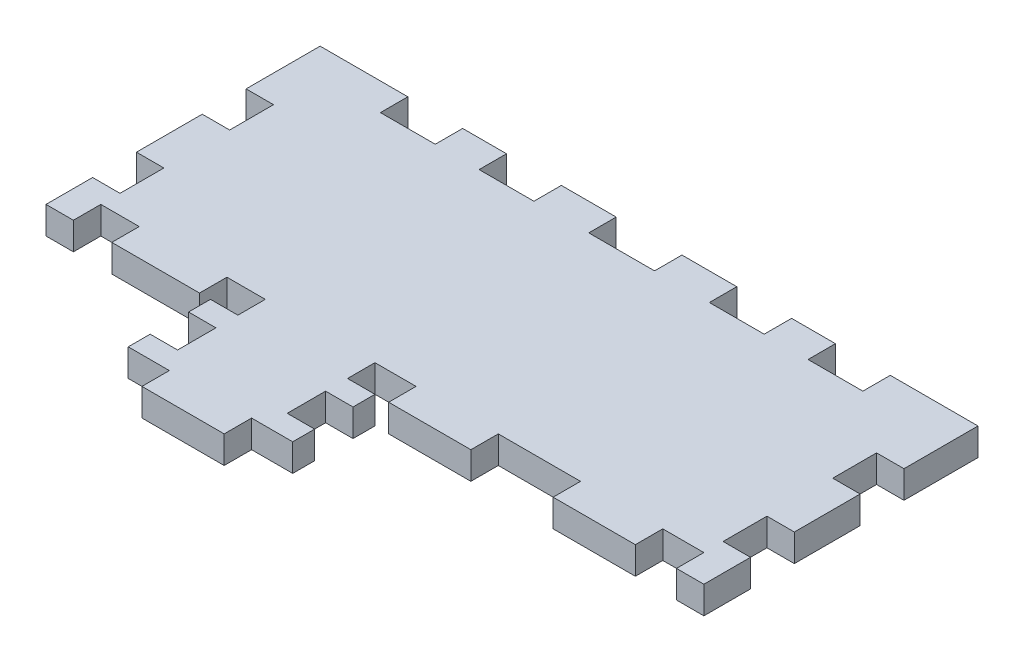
ISO-10303-21;
HEADER;
FILE_DESCRIPTION(('STEP AP214'),'2;1');
FILE_NAME('part.step','',(''),(''),'','','');
FILE_SCHEMA(('AUTOMOTIVE_DESIGN { 1 0 10303 214 1 1 1 1 }'));
ENDSEC;
DATA;
#1=APPLICATION_CONTEXT('core data for automotive mechanical design processes');
#2=APPLICATION_PROTOCOL_DEFINITION('international standard','automotive_design',2000,#1);
#3=PRODUCT_CONTEXT('',#1,'mechanical');
#4=PRODUCT('Part','Part','',(#3));
#5=PRODUCT_RELATED_PRODUCT_CATEGORY('part','',(#4));
#6=PRODUCT_DEFINITION_FORMATION('','',#4);
#7=PRODUCT_DEFINITION_CONTEXT('part definition',#1,'design');
#8=PRODUCT_DEFINITION('design','',#6,#7);
#9=PRODUCT_DEFINITION_SHAPE('','',#8);
#10=(LENGTH_UNIT() NAMED_UNIT(*) SI_UNIT(.MILLI.,.METRE.));
#11=(NAMED_UNIT(*) PLANE_ANGLE_UNIT() SI_UNIT($,.RADIAN.));
#12=(NAMED_UNIT(*) SI_UNIT($,.STERADIAN.) SOLID_ANGLE_UNIT());
#13=UNCERTAINTY_MEASURE_WITH_UNIT(LENGTH_MEASURE(1.E-05),#10,'distance_accuracy_value','');
#14=(GEOMETRIC_REPRESENTATION_CONTEXT(3) GLOBAL_UNCERTAINTY_ASSIGNED_CONTEXT((#13)) GLOBAL_UNIT_ASSIGNED_CONTEXT((#10,
#11,#12)) REPRESENTATION_CONTEXT('',''));
#15=CARTESIAN_POINT('',(0.,0.,0.));
#16=DIRECTION('',(0.,0.,1.));
#17=DIRECTION('',(1.,0.,0.));
#18=AXIS2_PLACEMENT_3D('',#15,#16,#17);
#19=CARTESIAN_POINT('',(-107.95,6.35,0.));
#20=DIRECTION('',(-1.,0.,0.));
#21=DIRECTION('',(0.,0.,1.));
#22=AXIS2_PLACEMENT_3D('',#19,#20,#21);
#23=PLANE('',#22);
#24=DIRECTION('',(0.,0.,-1.));
#25=VECTOR('',#24,1.);
#26=CARTESIAN_POINT('',(-107.95,0.,0.));
#27=LINE('',#26,#25);
#28=CARTESIAN_POINT('',(-107.95,0.,0.));
#29=VERTEX_POINT('',#28);
#30=CARTESIAN_POINT('',(-107.95,0.,-6.35));
#31=VERTEX_POINT('',#30);
#32=EDGE_CURVE('E554',#29,#31,#27,.T.);
#33=ORIENTED_EDGE('',*,*,#32,.F.);
#34=DIRECTION('',(0.,-1.,0.));
#35=VECTOR('',#34,1.);
#36=CARTESIAN_POINT('',(-107.95,6.35,0.));
#37=LINE('',#36,#35);
#38=CARTESIAN_POINT('',(-107.95,6.35,0.));
#39=VERTEX_POINT('',#38);
#40=EDGE_CURVE('E11',#39,#29,#37,.T.);
#41=ORIENTED_EDGE('',*,*,#40,.F.);
#42=DIRECTION('',(0.,0.,-1.));
#43=VECTOR('',#42,1.);
#44=CARTESIAN_POINT('',(-107.95,6.35,0.));
#45=LINE('',#44,#43);
#46=CARTESIAN_POINT('',(-107.95,6.35,-6.35));
#47=VERTEX_POINT('',#46);
#48=EDGE_CURVE('E797',#39,#47,#45,.T.);
#49=ORIENTED_EDGE('',*,*,#48,.T.);
#50=DIRECTION('',(0.,-1.,0.));
#51=VECTOR('',#50,1.);
#52=CARTESIAN_POINT('',(-107.95,6.35,-6.35));
#53=LINE('',#52,#51);
#54=EDGE_CURVE('E303',#47,#31,#53,.T.);
#55=ORIENTED_EDGE('',*,*,#54,.T.);
#56=EDGE_LOOP('',(#33,#41,#49,#55));
#57=FACE_BOUND('',#56,.T.);
#58=ADVANCED_FACE('F47',(#57),#23,.T.);
#59=CARTESIAN_POINT('',(0.,6.35,0.));
#60=DIRECTION('',(0.,0.,-1.));
#61=DIRECTION('',(-1.,0.,0.));
#62=AXIS2_PLACEMENT_3D('',#59,#60,#61);
#63=PLANE('',#62);
#64=DIRECTION('',(1.,0.,0.));
#65=VECTOR('',#64,1.);
#66=CARTESIAN_POINT('',(0.,0.,0.));
#67=LINE('',#66,#65);
#68=CARTESIAN_POINT('',(-114.3,0.,0.));
#69=VERTEX_POINT('',#68);
#70=EDGE_CURVE('E558',#69,#29,#67,.T.);
#71=ORIENTED_EDGE('',*,*,#70,.F.);
#72=DIRECTION('',(0.,-1.,0.));
#73=VECTOR('',#72,1.);
#74=CARTESIAN_POINT('',(-114.3,6.35,0.));
#75=LINE('',#74,#73);
#76=CARTESIAN_POINT('',(-114.3,6.35,0.));
#77=VERTEX_POINT('',#76);
#78=EDGE_CURVE('E56',#77,#69,#75,.T.);
#79=ORIENTED_EDGE('',*,*,#78,.F.);
#80=DIRECTION('',(1.,0.,0.));
#81=VECTOR('',#80,1.);
#82=CARTESIAN_POINT('',(0.,6.35,0.));
#83=LINE('',#82,#81);
#84=EDGE_CURVE('E1044',#77,#39,#83,.T.);
#85=ORIENTED_EDGE('',*,*,#84,.T.);
#86=ORIENTED_EDGE('',*,*,#40,.T.);
#87=EDGE_LOOP('',(#71,#79,#85,#86));
#88=FACE_BOUND('',#87,.T.);
#89=ADVANCED_FACE('F1043',(#88),#63,.T.);
#90=CARTESIAN_POINT('',(-114.3,6.35,0.));
#91=DIRECTION('',(1.,0.,0.));
#92=DIRECTION('',(0.,0.,-1.));
#93=AXIS2_PLACEMENT_3D('',#90,#91,#92);
#94=PLANE('',#93);
#95=DIRECTION('',(0.,0.,1.));
#96=VECTOR('',#95,1.);
#97=CARTESIAN_POINT('',(-114.3,0.,0.));
#98=LINE('',#97,#96);
#99=CARTESIAN_POINT('',(-114.3,0.,5.08));
#100=VERTEX_POINT('',#99);
#101=EDGE_CURVE('E563',#69,#100,#98,.T.);
#102=ORIENTED_EDGE('',*,*,#101,.T.);
#103=DIRECTION('',(0.,-1.,0.));
#104=VECTOR('',#103,1.);
#105=CARTESIAN_POINT('',(-114.3,6.35,5.08));
#106=LINE('',#105,#104);
#107=CARTESIAN_POINT('',(-114.3,6.35,5.08));
#108=VERTEX_POINT('',#107);
#109=EDGE_CURVE('E1025',#108,#100,#106,.T.);
#110=ORIENTED_EDGE('',*,*,#109,.F.);
#111=DIRECTION('',(0.,0.,1.));
#112=VECTOR('',#111,1.);
#113=CARTESIAN_POINT('',(-114.3,6.35,0.));
#114=LINE('',#113,#112);
#115=EDGE_CURVE('E1034',#77,#108,#114,.T.);
#116=ORIENTED_EDGE('',*,*,#115,.F.);
#117=ORIENTED_EDGE('',*,*,#78,.T.);
#118=EDGE_LOOP('',(#102,#110,#116,#117));
#119=FACE_BOUND('',#118,.T.);
#120=ADVANCED_FACE('F1032',(#119),#94,.F.);
#121=CARTESIAN_POINT('',(0.,6.35,5.08));
#122=DIRECTION('',(0.,0.,-1.));
#123=DIRECTION('',(-1.,0.,0.));
#124=AXIS2_PLACEMENT_3D('',#121,#122,#123);
#125=PLANE('',#124);
#126=DIRECTION('',(1.,0.,0.));
#127=VECTOR('',#126,1.);
#128=CARTESIAN_POINT('',(0.,0.,5.08));
#129=LINE('',#128,#127);
#130=CARTESIAN_POINT('',(-107.95,0.,5.08));
#131=VERTEX_POINT('',#130);
#132=EDGE_CURVE('E567',#100,#131,#129,.T.);
#133=ORIENTED_EDGE('',*,*,#132,.T.);
#134=DIRECTION('',(0.,-1.,0.));
#135=VECTOR('',#134,1.);
#136=CARTESIAN_POINT('',(-107.95,6.35,5.08));
#137=LINE('',#136,#135);
#138=CARTESIAN_POINT('',(-107.95,6.35,5.08));
#139=VERTEX_POINT('',#138);
#140=EDGE_CURVE('E1021',#139,#131,#137,.T.);
#141=ORIENTED_EDGE('',*,*,#140,.F.);
#142=DIRECTION('',(1.,0.,0.));
#143=VECTOR('',#142,1.);
#144=CARTESIAN_POINT('',(0.,6.35,5.08));
#145=LINE('',#144,#143);
#146=EDGE_CURVE('E1059',#108,#139,#145,.T.);
#147=ORIENTED_EDGE('',*,*,#146,.F.);
#148=ORIENTED_EDGE('',*,*,#109,.T.);
#149=EDGE_LOOP('',(#133,#141,#147,#148));
#150=FACE_BOUND('',#149,.T.);
#151=ADVANCED_FACE('F1406',(#150),#125,.F.);
#152=CARTESIAN_POINT('',(-107.95,6.35,0.));
#153=DIRECTION('',(1.,0.,0.));
#154=DIRECTION('',(0.,0.,-1.));
#155=AXIS2_PLACEMENT_3D('',#152,#153,#154);
#156=PLANE('',#155);
#157=DIRECTION('',(0.,0.,1.));
#158=VECTOR('',#157,1.);
#159=CARTESIAN_POINT('',(-107.95,0.,0.));
#160=LINE('',#159,#158);
#161=CARTESIAN_POINT('',(-107.95,0.,13.97));
#162=VERTEX_POINT('',#161);
#163=EDGE_CURVE('E571',#131,#162,#160,.T.);
#164=ORIENTED_EDGE('',*,*,#163,.T.);
#165=DIRECTION('',(0.,-1.,0.));
#166=VECTOR('',#165,1.);
#167=CARTESIAN_POINT('',(-107.95,6.35,13.97));
#168=LINE('',#167,#166);
#169=CARTESIAN_POINT('',(-107.95,6.35,13.97));
#170=VERTEX_POINT('',#169);
#171=EDGE_CURVE('E1018',#170,#162,#168,.T.);
#172=ORIENTED_EDGE('',*,*,#171,.F.);
#173=DIRECTION('',(0.,0.,1.));
#174=VECTOR('',#173,1.);
#175=CARTESIAN_POINT('',(-107.95,6.35,0.));
#176=LINE('',#175,#174);
#177=EDGE_CURVE('E1063',#139,#170,#176,.T.);
#178=ORIENTED_EDGE('',*,*,#177,.F.);
#179=ORIENTED_EDGE('',*,*,#140,.T.);
#180=EDGE_LOOP('',(#164,#172,#178,#179));
#181=FACE_BOUND('',#180,.T.);
#182=ADVANCED_FACE('F2230',(#181),#156,.F.);
#183=CARTESIAN_POINT('',(0.,6.35,13.97));
#184=DIRECTION('',(0.,0.,-1.));
#185=DIRECTION('',(-1.,0.,0.));
#186=AXIS2_PLACEMENT_3D('',#183,#184,#185);
#187=PLANE('',#186);
#188=DIRECTION('',(1.,0.,0.));
#189=VECTOR('',#188,1.);
#190=CARTESIAN_POINT('',(0.,0.,13.97));
#191=LINE('',#190,#189);
#192=CARTESIAN_POINT('',(-114.3,0.,13.97));
#193=VERTEX_POINT('',#192);
#194=EDGE_CURVE('E575',#193,#162,#191,.T.);
#195=ORIENTED_EDGE('',*,*,#194,.F.);
#196=DIRECTION('',(0.,-1.,0.));
#197=VECTOR('',#196,1.);
#198=CARTESIAN_POINT('',(-114.3,6.35,13.97));
#199=LINE('',#198,#197);
#200=CARTESIAN_POINT('',(-114.3,6.35,13.97));
#201=VERTEX_POINT('',#200);
#202=EDGE_CURVE('E1015',#201,#193,#199,.T.);
#203=ORIENTED_EDGE('',*,*,#202,.F.);
#204=DIRECTION('',(1.,0.,0.));
#205=VECTOR('',#204,1.);
#206=CARTESIAN_POINT('',(0.,6.35,13.97));
#207=LINE('',#206,#205);
#208=EDGE_CURVE('E1066',#201,#170,#207,.T.);
#209=ORIENTED_EDGE('',*,*,#208,.T.);
#210=ORIENTED_EDGE('',*,*,#171,.T.);
#211=EDGE_LOOP('',(#195,#203,#209,#210));
#212=FACE_BOUND('',#211,.T.);
#213=ADVANCED_FACE('F2222',(#212),#187,.T.);
#214=CARTESIAN_POINT('',(-114.3,0.,19.05));
#215=VERTEX_POINT('',#214);
#216=EDGE_CURVE('E568',#193,#215,#98,.T.);
#217=ORIENTED_EDGE('',*,*,#216,.T.);
#218=DIRECTION('',(0.,-1.,0.));
#219=VECTOR('',#218,1.);
#220=CARTESIAN_POINT('',(-114.3,6.35,19.05));
#221=LINE('',#220,#219);
#222=CARTESIAN_POINT('',(-114.3,6.35,19.05));
#223=VERTEX_POINT('',#222);
#224=EDGE_CURVE('E1011',#223,#215,#221,.T.);
#225=ORIENTED_EDGE('',*,*,#224,.F.);
#226=EDGE_CURVE('E1060',#201,#223,#114,.T.);
#227=ORIENTED_EDGE('',*,*,#226,.F.);
#228=ORIENTED_EDGE('',*,*,#202,.T.);
#229=EDGE_LOOP('',(#217,#225,#227,#228));
#230=FACE_BOUND('',#229,.T.);
#231=ADVANCED_FACE('F1408',(#230),#94,.F.);
#232=CARTESIAN_POINT('',(0.,6.35,19.05));
#233=DIRECTION('',(0.,0.,-1.));
#234=DIRECTION('',(-1.,0.,0.));
#235=AXIS2_PLACEMENT_3D('',#232,#233,#234);
#236=PLANE('',#235);
#237=DIRECTION('',(1.,0.,0.));
#238=VECTOR('',#237,1.);
#239=CARTESIAN_POINT('',(0.,0.,19.05));
#240=LINE('',#239,#238);
#241=CARTESIAN_POINT('',(-104.775,0.,19.05));
#242=VERTEX_POINT('',#241);
#243=EDGE_CURVE('E579',#215,#242,#240,.T.);
#244=ORIENTED_EDGE('',*,*,#243,.T.);
#245=DIRECTION('',(0.,-1.,0.));
#246=VECTOR('',#245,1.);
#247=CARTESIAN_POINT('',(-104.775,6.35,19.05));
#248=LINE('',#247,#246);
#249=CARTESIAN_POINT('',(-104.775,6.35,19.05));
#250=VERTEX_POINT('',#249);
#251=EDGE_CURVE('E1007',#250,#242,#248,.T.);
#252=ORIENTED_EDGE('',*,*,#251,.F.);
#253=DIRECTION('',(1.,0.,0.));
#254=VECTOR('',#253,1.);
#255=CARTESIAN_POINT('',(0.,6.35,19.05));
#256=LINE('',#255,#254);
#257=EDGE_CURVE('E1070',#223,#250,#256,.T.);
#258=ORIENTED_EDGE('',*,*,#257,.F.);
#259=ORIENTED_EDGE('',*,*,#224,.T.);
#260=EDGE_LOOP('',(#244,#252,#258,#259));
#261=FACE_BOUND('',#260,.T.);
#262=ADVANCED_FACE('F1472',(#261),#236,.F.);
#263=CARTESIAN_POINT('',(-104.775,6.35,0.));
#264=DIRECTION('',(1.,0.,0.));
#265=DIRECTION('',(0.,0.,-1.));
#266=AXIS2_PLACEMENT_3D('',#263,#264,#265);
#267=PLANE('',#266);
#268=DIRECTION('',(0.,0.,1.));
#269=VECTOR('',#268,1.);
#270=CARTESIAN_POINT('',(-104.775,0.,0.));
#271=LINE('',#270,#269);
#272=CARTESIAN_POINT('',(-104.775,0.,25.4));
#273=VERTEX_POINT('',#272);
#274=EDGE_CURVE('E582',#242,#273,#271,.T.);
#275=ORIENTED_EDGE('',*,*,#274,.T.);
#276=DIRECTION('',(0.,-1.,0.));
#277=VECTOR('',#276,1.);
#278=CARTESIAN_POINT('',(-104.775,6.35,25.4));
#279=LINE('',#278,#277);
#280=CARTESIAN_POINT('',(-104.775,6.35,25.4));
#281=VERTEX_POINT('',#280);
#282=EDGE_CURVE('E1003',#281,#273,#279,.T.);
#283=ORIENTED_EDGE('',*,*,#282,.F.);
#284=DIRECTION('',(0.,0.,1.));
#285=VECTOR('',#284,1.);
#286=CARTESIAN_POINT('',(-104.775,6.35,0.));
#287=LINE('',#286,#285);
#288=EDGE_CURVE('E1073',#250,#281,#287,.T.);
#289=ORIENTED_EDGE('',*,*,#288,.F.);
#290=ORIENTED_EDGE('',*,*,#251,.T.);
#291=EDGE_LOOP('',(#275,#283,#289,#290));
#292=FACE_BOUND('',#291,.T.);
#293=ADVANCED_FACE('F1466',(#292),#267,.F.);
#294=CARTESIAN_POINT('',(0.,6.35,25.4));
#295=DIRECTION('',(0.,0.,-1.));
#296=DIRECTION('',(-1.,0.,0.));
#297=AXIS2_PLACEMENT_3D('',#294,#295,#296);
#298=PLANE('',#297);
#299=DIRECTION('',(1.,0.,0.));
#300=VECTOR('',#299,1.);
#301=CARTESIAN_POINT('',(0.,0.,25.4));
#302=LINE('',#301,#300);
#303=CARTESIAN_POINT('',(-85.725,0.,25.4));
#304=VERTEX_POINT('',#303);
#305=EDGE_CURVE('E585',#273,#304,#302,.T.);
#306=ORIENTED_EDGE('',*,*,#305,.T.);
#307=DIRECTION('',(0.,-1.,0.));
#308=VECTOR('',#307,1.);
#309=CARTESIAN_POINT('',(-85.725,6.35,25.4));
#310=LINE('',#309,#308);
#311=CARTESIAN_POINT('',(-85.725,6.35,25.4));
#312=VERTEX_POINT('',#311);
#313=EDGE_CURVE('E1000',#312,#304,#310,.T.);
#314=ORIENTED_EDGE('',*,*,#313,.F.);
#315=DIRECTION('',(1.,0.,0.));
#316=VECTOR('',#315,1.);
#317=CARTESIAN_POINT('',(0.,6.35,25.4));
#318=LINE('',#317,#316);
#319=EDGE_CURVE('E1076',#281,#312,#318,.T.);
#320=ORIENTED_EDGE('',*,*,#319,.F.);
#321=ORIENTED_EDGE('',*,*,#282,.T.);
#322=EDGE_LOOP('',(#306,#314,#320,#321));
#323=FACE_BOUND('',#322,.T.);
#324=ADVANCED_FACE('F1462',(#323),#298,.F.);
#325=CARTESIAN_POINT('',(-85.725,6.35,0.));
#326=DIRECTION('',(1.,0.,0.));
#327=DIRECTION('',(0.,0.,-1.));
#328=AXIS2_PLACEMENT_3D('',#325,#326,#327);
#329=PLANE('',#328);
#330=DIRECTION('',(0.,0.,1.));
#331=VECTOR('',#330,1.);
#332=CARTESIAN_POINT('',(-85.725,0.,0.));
#333=LINE('',#332,#331);
#334=CARTESIAN_POINT('',(-85.725,0.,19.05));
#335=VERTEX_POINT('',#334);
#336=EDGE_CURVE('E589',#335,#304,#333,.T.);
#337=ORIENTED_EDGE('',*,*,#336,.F.);
#338=DIRECTION('',(0.,-1.,0.));
#339=VECTOR('',#338,1.);
#340=CARTESIAN_POINT('',(-85.725,6.35,19.05));
#341=LINE('',#340,#339);
#342=CARTESIAN_POINT('',(-85.725,6.35,19.05));
#343=VERTEX_POINT('',#342);
#344=EDGE_CURVE('E997',#343,#335,#341,.T.);
#345=ORIENTED_EDGE('',*,*,#344,.F.);
#346=DIRECTION('',(0.,0.,1.));
#347=VECTOR('',#346,1.);
#348=CARTESIAN_POINT('',(-85.725,6.35,0.));
#349=LINE('',#348,#347);
#350=EDGE_CURVE('E1079',#343,#312,#349,.T.);
#351=ORIENTED_EDGE('',*,*,#350,.T.);
#352=ORIENTED_EDGE('',*,*,#313,.T.);
#353=EDGE_LOOP('',(#337,#345,#351,#352));
#354=FACE_BOUND('',#353,.T.);
#355=ADVANCED_FACE('F1457',(#354),#329,.T.);
#356=CARTESIAN_POINT('',(0.,6.35,19.05));
#357=DIRECTION('',(0.,0.,1.));
#358=DIRECTION('',(1.,0.,0.));
#359=AXIS2_PLACEMENT_3D('',#356,#357,#358);
#360=PLANE('',#359);
#361=DIRECTION('',(-1.,0.,0.));
#362=VECTOR('',#361,1.);
#363=CARTESIAN_POINT('',(0.,0.,19.05));
#364=LINE('',#363,#362);
#365=CARTESIAN_POINT('',(-76.2,0.,19.05));
#366=VERTEX_POINT('',#365);
#367=EDGE_CURVE('E593',#366,#335,#364,.T.);
#368=ORIENTED_EDGE('',*,*,#367,.F.);
#369=DIRECTION('',(0.,-1.,0.));
#370=VECTOR('',#369,1.);
#371=CARTESIAN_POINT('',(-76.2,6.35,19.05));
#372=LINE('',#371,#370);
#373=CARTESIAN_POINT('',(-76.2,6.35,19.05));
#374=VERTEX_POINT('',#373);
#375=EDGE_CURVE('E994',#374,#366,#372,.T.);
#376=ORIENTED_EDGE('',*,*,#375,.F.);
#377=DIRECTION('',(-1.,0.,0.));
#378=VECTOR('',#377,1.);
#379=CARTESIAN_POINT('',(0.,6.35,19.05));
#380=LINE('',#379,#378);
#381=EDGE_CURVE('E1083',#374,#343,#380,.T.);
#382=ORIENTED_EDGE('',*,*,#381,.T.);
#383=ORIENTED_EDGE('',*,*,#344,.T.);
#384=EDGE_LOOP('',(#368,#376,#382,#383));
#385=FACE_BOUND('',#384,.T.);
#386=ADVANCED_FACE('F1452',(#385),#360,.T.);
#387=CARTESIAN_POINT('',(-76.2,6.35,0.));
#388=DIRECTION('',(1.,0.,0.));
#389=DIRECTION('',(0.,0.,-1.));
#390=AXIS2_PLACEMENT_3D('',#387,#388,#389);
#391=PLANE('',#390);
#392=DIRECTION('',(0.,0.,1.));
#393=VECTOR('',#392,1.);
#394=CARTESIAN_POINT('',(-76.2,0.,0.));
#395=LINE('',#394,#393);
#396=CARTESIAN_POINT('',(-76.2,0.,13.97));
#397=VERTEX_POINT('',#396);
#398=EDGE_CURVE('E597',#397,#366,#395,.T.);
#399=ORIENTED_EDGE('',*,*,#398,.F.);
#400=DIRECTION('',(0.,-1.,0.));
#401=VECTOR('',#400,1.);
#402=CARTESIAN_POINT('',(-76.2,6.35,13.97));
#403=LINE('',#402,#401);
#404=CARTESIAN_POINT('',(-76.2,6.35,13.97));
#405=VERTEX_POINT('',#404);
#406=EDGE_CURVE('E991',#405,#397,#403,.T.);
#407=ORIENTED_EDGE('',*,*,#406,.F.);
#408=DIRECTION('',(0.,0.,1.));
#409=VECTOR('',#408,1.);
#410=CARTESIAN_POINT('',(-76.2,6.35,0.));
#411=LINE('',#410,#409);
#412=EDGE_CURVE('E1087',#405,#374,#411,.T.);
#413=ORIENTED_EDGE('',*,*,#412,.T.);
#414=ORIENTED_EDGE('',*,*,#375,.T.);
#415=EDGE_LOOP('',(#399,#407,#413,#414));
#416=FACE_BOUND('',#415,.T.);
#417=ADVANCED_FACE('F1423',(#416),#391,.T.);
#418=CARTESIAN_POINT('',(0.,6.35,13.97));
#419=DIRECTION('',(0.,0.,1.));
#420=DIRECTION('',(1.,0.,0.));
#421=AXIS2_PLACEMENT_3D('',#418,#419,#420);
#422=PLANE('',#421);
#423=DIRECTION('',(-1.,0.,0.));
#424=VECTOR('',#423,1.);
#425=CARTESIAN_POINT('',(0.,0.,13.97));
#426=LINE('',#425,#424);
#427=CARTESIAN_POINT('',(-82.55,0.,13.97));
#428=VERTEX_POINT('',#427);
#429=EDGE_CURVE('E601',#397,#428,#426,.T.);
#430=ORIENTED_EDGE('',*,*,#429,.T.);
#431=DIRECTION('',(0.,-1.,0.));
#432=VECTOR('',#431,1.);
#433=CARTESIAN_POINT('',(-82.55,6.35,13.97));
#434=LINE('',#433,#432);
#435=CARTESIAN_POINT('',(-82.55,6.35,13.97));
#436=VERTEX_POINT('',#435);
#437=EDGE_CURVE('E988',#436,#428,#434,.T.);
#438=ORIENTED_EDGE('',*,*,#437,.F.);
#439=DIRECTION('',(-1.,0.,0.));
#440=VECTOR('',#439,1.);
#441=CARTESIAN_POINT('',(0.,6.35,13.97));
#442=LINE('',#441,#440);
#443=EDGE_CURVE('E1091',#405,#436,#442,.T.);
#444=ORIENTED_EDGE('',*,*,#443,.F.);
#445=ORIENTED_EDGE('',*,*,#406,.T.);
#446=EDGE_LOOP('',(#430,#438,#444,#445));
#447=FACE_BOUND('',#446,.T.);
#448=ADVANCED_FACE('F2158',(#447),#422,.F.);
#449=CARTESIAN_POINT('',(-82.55,6.35,0.));
#450=DIRECTION('',(1.,0.,0.));
#451=DIRECTION('',(0.,0.,-1.));
#452=AXIS2_PLACEMENT_3D('',#449,#450,#451);
#453=PLANE('',#452);
#454=DIRECTION('',(0.,0.,1.));
#455=VECTOR('',#454,1.);
#456=CARTESIAN_POINT('',(-82.55,0.,0.));
#457=LINE('',#456,#455);
#458=CARTESIAN_POINT('',(-82.55,0.,5.08000000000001));
#459=VERTEX_POINT('',#458);
#460=EDGE_CURVE('E606',#459,#428,#457,.T.);
#461=ORIENTED_EDGE('',*,*,#460,.F.);
#462=DIRECTION('',(0.,-1.,0.));
#463=VECTOR('',#462,1.);
#464=CARTESIAN_POINT('',(-82.55,6.35,5.08000000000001));
#465=LINE('',#464,#463);
#466=CARTESIAN_POINT('',(-82.55,6.35,5.08000000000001));
#467=VERTEX_POINT('',#466);
#468=EDGE_CURVE('E985',#467,#459,#465,.T.);
#469=ORIENTED_EDGE('',*,*,#468,.F.);
#470=DIRECTION('',(0.,0.,1.));
#471=VECTOR('',#470,1.);
#472=CARTESIAN_POINT('',(-82.55,6.35,0.));
#473=LINE('',#472,#471);
#474=EDGE_CURVE('E1095',#467,#436,#473,.T.);
#475=ORIENTED_EDGE('',*,*,#474,.T.);
#476=ORIENTED_EDGE('',*,*,#437,.T.);
#477=EDGE_LOOP('',(#461,#469,#475,#476));
#478=FACE_BOUND('',#477,.T.);
#479=ADVANCED_FACE('F1441',(#478),#453,.T.);
#480=CARTESIAN_POINT('',(0.,6.35,5.08000000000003));
#481=DIRECTION('',(0.,0.,1.));
#482=DIRECTION('',(1.,0.,0.));
#483=AXIS2_PLACEMENT_3D('',#480,#481,#482);
#484=PLANE('',#483);
#485=DIRECTION('',(-1.,0.,0.));
#486=VECTOR('',#485,1.);
#487=CARTESIAN_POINT('',(0.,0.,5.08000000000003));
#488=LINE('',#487,#486);
#489=CARTESIAN_POINT('',(-76.2,0.,5.08000000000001));
#490=VERTEX_POINT('',#489);
#491=EDGE_CURVE('E610',#490,#459,#488,.T.);
#492=ORIENTED_EDGE('',*,*,#491,.F.);
#493=DIRECTION('',(0.,-1.,0.));
#494=VECTOR('',#493,1.);
#495=CARTESIAN_POINT('',(-76.2,6.35,5.08000000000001));
#496=LINE('',#495,#494);
#497=CARTESIAN_POINT('',(-76.2,6.35,5.08000000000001));
#498=VERTEX_POINT('',#497);
#499=EDGE_CURVE('E982',#498,#490,#496,.T.);
#500=ORIENTED_EDGE('',*,*,#499,.F.);
#501=DIRECTION('',(-1.,0.,0.));
#502=VECTOR('',#501,1.);
#503=CARTESIAN_POINT('',(0.,6.35,5.08000000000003));
#504=LINE('',#503,#502);
#505=EDGE_CURVE('E1099',#498,#467,#504,.T.);
#506=ORIENTED_EDGE('',*,*,#505,.T.);
#507=ORIENTED_EDGE('',*,*,#468,.T.);
#508=EDGE_LOOP('',(#492,#500,#506,#507));
#509=FACE_BOUND('',#508,.T.);
#510=ADVANCED_FACE('F1421',(#509),#484,.T.);
#511=CARTESIAN_POINT('',(-76.2,0.,0.));
#512=VERTEX_POINT('',#511);
#513=EDGE_CURVE('E602',#512,#490,#395,.T.);
#514=ORIENTED_EDGE('',*,*,#513,.F.);
#515=DIRECTION('',(0.,-1.,0.));
#516=VECTOR('',#515,1.);
#517=CARTESIAN_POINT('',(-76.2,6.35,0.));
#518=LINE('',#517,#516);
#519=CARTESIAN_POINT('',(-76.2,6.35,0.));
#520=VERTEX_POINT('',#519);
#521=EDGE_CURVE('E979',#520,#512,#518,.T.);
#522=ORIENTED_EDGE('',*,*,#521,.F.);
#523=EDGE_CURVE('E1092',#520,#498,#411,.T.);
#524=ORIENTED_EDGE('',*,*,#523,.T.);
#525=ORIENTED_EDGE('',*,*,#499,.T.);
#526=EDGE_LOOP('',(#514,#522,#524,#525));
#527=FACE_BOUND('',#526,.T.);
#528=ADVANCED_FACE('F1413',(#527),#391,.T.);
#529=CARTESIAN_POINT('',(-82.55,0.,0.));
#530=VERTEX_POINT('',#529);
#531=EDGE_CURVE('E564',#530,#512,#67,.T.);
#532=ORIENTED_EDGE('',*,*,#531,.F.);
#533=DIRECTION('',(0.,-1.,0.));
#534=VECTOR('',#533,1.);
#535=CARTESIAN_POINT('',(-82.55,6.35,0.));
#536=LINE('',#535,#534);
#537=CARTESIAN_POINT('',(-82.55,6.35,0.));
#538=VERTEX_POINT('',#537);
#539=EDGE_CURVE('E976',#538,#530,#536,.T.);
#540=ORIENTED_EDGE('',*,*,#539,.F.);
#541=EDGE_CURVE('E1052',#538,#520,#83,.T.);
#542=ORIENTED_EDGE('',*,*,#541,.T.);
#543=ORIENTED_EDGE('',*,*,#521,.T.);
#544=EDGE_LOOP('',(#532,#540,#542,#543));
#545=FACE_BOUND('',#544,.T.);
#546=ADVANCED_FACE('F1402',(#545),#63,.T.);
#547=CARTESIAN_POINT('',(-82.55,6.35,0.));
#548=DIRECTION('',(-1.,0.,0.));
#549=DIRECTION('',(0.,0.,1.));
#550=AXIS2_PLACEMENT_3D('',#547,#548,#549);
#551=PLANE('',#550);
#552=DIRECTION('',(0.,0.,-1.));
#553=VECTOR('',#552,1.);
#554=CARTESIAN_POINT('',(-82.55,0.,0.));
#555=LINE('',#554,#553);
#556=CARTESIAN_POINT('',(-82.55,0.,-6.35));
#557=VERTEX_POINT('',#556);
#558=EDGE_CURVE('E614',#530,#557,#555,.T.);
#559=ORIENTED_EDGE('',*,*,#558,.T.);
#560=DIRECTION('',(0.,-1.,0.));
#561=VECTOR('',#560,1.);
#562=CARTESIAN_POINT('',(-82.55,6.35,-6.35));
#563=LINE('',#562,#561);
#564=CARTESIAN_POINT('',(-82.55,6.35,-6.35));
#565=VERTEX_POINT('',#564);
#566=EDGE_CURVE('E973',#565,#557,#563,.T.);
#567=ORIENTED_EDGE('',*,*,#566,.F.);
#568=DIRECTION('',(0.,0.,-1.));
#569=VECTOR('',#568,1.);
#570=CARTESIAN_POINT('',(-82.55,6.35,0.));
#571=LINE('',#570,#569);
#572=EDGE_CURVE('E1103',#538,#565,#571,.T.);
#573=ORIENTED_EDGE('',*,*,#572,.F.);
#574=ORIENTED_EDGE('',*,*,#539,.T.);
#575=EDGE_LOOP('',(#559,#567,#573,#574));
#576=FACE_BOUND('',#575,.T.);
#577=ADVANCED_FACE('F1412',(#576),#551,.F.);
#578=CARTESIAN_POINT('',(0.,6.35,-6.34999999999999));
#579=DIRECTION('',(0.,0.,1.));
#580=DIRECTION('',(1.,0.,0.));
#581=AXIS2_PLACEMENT_3D('',#578,#579,#580);
#582=PLANE('',#581);
#583=DIRECTION('',(-1.,0.,0.));
#584=VECTOR('',#583,1.);
#585=CARTESIAN_POINT('',(0.,0.,-6.34999999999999));
#586=LINE('',#585,#584);
#587=CARTESIAN_POINT('',(-73.025,0.,-6.35));
#588=VERTEX_POINT('',#587);
#589=EDGE_CURVE('E618',#588,#557,#586,.T.);
#590=ORIENTED_EDGE('',*,*,#589,.F.);
#591=DIRECTION('',(0.,-1.,0.));
#592=VECTOR('',#591,1.);
#593=CARTESIAN_POINT('',(-73.025,6.35,-6.35));
#594=LINE('',#593,#592);
#595=CARTESIAN_POINT('',(-73.025,6.35,-6.35));
#596=VERTEX_POINT('',#595);
#597=EDGE_CURVE('E970',#596,#588,#594,.T.);
#598=ORIENTED_EDGE('',*,*,#597,.F.);
#599=DIRECTION('',(-1.,0.,0.));
#600=VECTOR('',#599,1.);
#601=CARTESIAN_POINT('',(0.,6.35,-6.34999999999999));
#602=LINE('',#601,#600);
#603=EDGE_CURVE('E1106',#596,#565,#602,.T.);
#604=ORIENTED_EDGE('',*,*,#603,.T.);
#605=ORIENTED_EDGE('',*,*,#566,.T.);
#606=EDGE_LOOP('',(#590,#598,#604,#605));
#607=FACE_BOUND('',#606,.T.);
#608=ADVANCED_FACE('F1419',(#607),#582,.T.);
#609=CARTESIAN_POINT('',(-73.025,6.35,0.));
#610=DIRECTION('',(-1.,0.,0.));
#611=DIRECTION('',(0.,0.,1.));
#612=AXIS2_PLACEMENT_3D('',#609,#610,#611);
#613=PLANE('',#612);
#614=DIRECTION('',(0.,0.,-1.));
#615=VECTOR('',#614,1.);
#616=CARTESIAN_POINT('',(-73.025,0.,0.));
#617=LINE('',#616,#615);
#618=CARTESIAN_POINT('',(-73.025,0.,0.));
#619=VERTEX_POINT('',#618);
#620=EDGE_CURVE('E622',#619,#588,#617,.T.);
#621=ORIENTED_EDGE('',*,*,#620,.F.);
#622=DIRECTION('',(0.,-1.,0.));
#623=VECTOR('',#622,1.);
#624=CARTESIAN_POINT('',(-73.025,6.35,0.));
#625=LINE('',#624,#623);
#626=CARTESIAN_POINT('',(-73.025,6.35,0.));
#627=VERTEX_POINT('',#626);
#628=EDGE_CURVE('E967',#627,#619,#625,.T.);
#629=ORIENTED_EDGE('',*,*,#628,.F.);
#630=DIRECTION('',(0.,0.,-1.));
#631=VECTOR('',#630,1.);
#632=CARTESIAN_POINT('',(-73.025,6.35,0.));
#633=LINE('',#632,#631);
#634=EDGE_CURVE('E1110',#627,#596,#633,.T.);
#635=ORIENTED_EDGE('',*,*,#634,.T.);
#636=ORIENTED_EDGE('',*,*,#597,.T.);
#637=EDGE_LOOP('',(#621,#629,#635,#636));
#638=FACE_BOUND('',#637,.T.);
#639=ADVANCED_FACE('F2098',(#638),#613,.T.);
#640=CARTESIAN_POINT('',(0.,6.35,0.));
#641=DIRECTION('',(0.,0.,-1.));
#642=DIRECTION('',(-1.,0.,0.));
#643=AXIS2_PLACEMENT_3D('',#640,#641,#642);
#644=PLANE('',#643);
#645=DIRECTION('',(1.,0.,0.));
#646=VECTOR('',#645,1.);
#647=CARTESIAN_POINT('',(0.,0.,0.));
#648=LINE('',#647,#646);
#649=CARTESIAN_POINT('',(-53.975,0.,0.));
#650=VERTEX_POINT('',#649);
#651=EDGE_CURVE('E626',#619,#650,#648,.T.);
#652=ORIENTED_EDGE('',*,*,#651,.T.);
#653=DIRECTION('',(0.,-1.,0.));
#654=VECTOR('',#653,1.);
#655=CARTESIAN_POINT('',(-53.975,6.35,0.));
#656=LINE('',#655,#654);
#657=CARTESIAN_POINT('',(-53.975,6.35,0.));
#658=VERTEX_POINT('',#657);
#659=EDGE_CURVE('E963',#658,#650,#656,.T.);
#660=ORIENTED_EDGE('',*,*,#659,.F.);
#661=DIRECTION('',(1.,0.,0.));
#662=VECTOR('',#661,1.);
#663=CARTESIAN_POINT('',(0.,6.35,0.));
#664=LINE('',#663,#662);
#665=EDGE_CURVE('E537',#627,#658,#664,.T.);
#666=ORIENTED_EDGE('',*,*,#665,.F.);
#667=ORIENTED_EDGE('',*,*,#628,.T.);
#668=EDGE_LOOP('',(#652,#660,#666,#667));
#669=FACE_BOUND('',#668,.T.);
#670=ADVANCED_FACE('F1775',(#669),#644,.F.);
#671=CARTESIAN_POINT('',(-53.975,6.35,0.));
#672=DIRECTION('',(-1.,0.,0.));
#673=DIRECTION('',(0.,0.,1.));
#674=AXIS2_PLACEMENT_3D('',#671,#672,#673);
#675=PLANE('',#674);
#676=DIRECTION('',(0.,0.,-1.));
#677=VECTOR('',#676,1.);
#678=CARTESIAN_POINT('',(-53.975,0.,0.));
#679=LINE('',#678,#677);
#680=CARTESIAN_POINT('',(-53.975,0.,-6.35));
#681=VERTEX_POINT('',#680);
#682=EDGE_CURVE('E629',#650,#681,#679,.T.);
#683=ORIENTED_EDGE('',*,*,#682,.T.);
#684=DIRECTION('',(0.,-1.,0.));
#685=VECTOR('',#684,1.);
#686=CARTESIAN_POINT('',(-53.975,6.35,-6.35));
#687=LINE('',#686,#685);
#688=CARTESIAN_POINT('',(-53.975,6.35,-6.35));
#689=VERTEX_POINT('',#688);
#690=EDGE_CURVE('E960',#689,#681,#687,.T.);
#691=ORIENTED_EDGE('',*,*,#690,.F.);
#692=DIRECTION('',(0.,0.,-1.));
#693=VECTOR('',#692,1.);
#694=CARTESIAN_POINT('',(-53.975,6.35,0.));
#695=LINE('',#694,#693);
#696=EDGE_CURVE('E1115',#658,#689,#695,.T.);
#697=ORIENTED_EDGE('',*,*,#696,.F.);
#698=ORIENTED_EDGE('',*,*,#659,.T.);
#699=EDGE_LOOP('',(#683,#691,#697,#698));
#700=FACE_BOUND('',#699,.T.);
#701=ADVANCED_FACE('F2079',(#700),#675,.F.);
#702=CARTESIAN_POINT('',(0.,6.35,-6.35000000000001));
#703=DIRECTION('',(0.,0.,1.));
#704=DIRECTION('',(1.,0.,0.));
#705=AXIS2_PLACEMENT_3D('',#702,#703,#704);
#706=PLANE('',#705);
#707=DIRECTION('',(-1.,0.,0.));
#708=VECTOR('',#707,1.);
#709=CARTESIAN_POINT('',(0.,0.,-6.35000000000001));
#710=LINE('',#709,#708);
#711=CARTESIAN_POINT('',(-34.925,0.,-6.35));
#712=VERTEX_POINT('',#711);
#713=EDGE_CURVE('E634',#712,#681,#710,.T.);
#714=ORIENTED_EDGE('',*,*,#713,.F.);
#715=DIRECTION('',(0.,-1.,0.));
#716=VECTOR('',#715,1.);
#717=CARTESIAN_POINT('',(-34.925,6.35,-6.35));
#718=LINE('',#717,#716);
#719=CARTESIAN_POINT('',(-34.925,6.35,-6.35));
#720=VERTEX_POINT('',#719);
#721=EDGE_CURVE('E957',#720,#712,#718,.T.);
#722=ORIENTED_EDGE('',*,*,#721,.F.);
#723=DIRECTION('',(-1.,0.,0.));
#724=VECTOR('',#723,1.);
#725=CARTESIAN_POINT('',(0.,6.35,-6.35000000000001));
#726=LINE('',#725,#724);
#727=EDGE_CURVE('E1119',#720,#689,#726,.T.);
#728=ORIENTED_EDGE('',*,*,#727,.T.);
#729=ORIENTED_EDGE('',*,*,#690,.T.);
#730=EDGE_LOOP('',(#714,#722,#728,#729));
#731=FACE_BOUND('',#730,.T.);
#732=ADVANCED_FACE('F2069',(#731),#706,.T.);
#733=CARTESIAN_POINT('',(-34.925,6.35,0.));
#734=DIRECTION('',(-1.,0.,0.));
#735=DIRECTION('',(0.,0.,1.));
#736=AXIS2_PLACEMENT_3D('',#733,#734,#735);
#737=PLANE('',#736);
#738=DIRECTION('',(0.,0.,-1.));
#739=VECTOR('',#738,1.);
#740=CARTESIAN_POINT('',(-34.925,0.,0.));
#741=LINE('',#740,#739);
#742=CARTESIAN_POINT('',(-34.925,0.,0.));
#743=VERTEX_POINT('',#742);
#744=EDGE_CURVE('E638',#743,#712,#741,.T.);
#745=ORIENTED_EDGE('',*,*,#744,.F.);
#746=DIRECTION('',(0.,-1.,0.));
#747=VECTOR('',#746,1.);
#748=CARTESIAN_POINT('',(-34.925,6.35,0.));
#749=LINE('',#748,#747);
#750=CARTESIAN_POINT('',(-34.925,6.35,0.));
#751=VERTEX_POINT('',#750);
#752=EDGE_CURVE('E954',#751,#743,#749,.T.);
#753=ORIENTED_EDGE('',*,*,#752,.F.);
#754=DIRECTION('',(0.,0.,-1.));
#755=VECTOR('',#754,1.);
#756=CARTESIAN_POINT('',(-34.925,6.35,0.));
#757=LINE('',#756,#755);
#758=EDGE_CURVE('E1123',#751,#720,#757,.T.);
#759=ORIENTED_EDGE('',*,*,#758,.T.);
#760=ORIENTED_EDGE('',*,*,#721,.T.);
#761=EDGE_LOOP('',(#745,#753,#759,#760));
#762=FACE_BOUND('',#761,.T.);
#763=ADVANCED_FACE('F2061',(#762),#737,.T.);
#764=CARTESIAN_POINT('',(-15.875,0.,0.));
#765=VERTEX_POINT('',#764);
#766=EDGE_CURVE('E630',#743,#765,#648,.T.);
#767=ORIENTED_EDGE('',*,*,#766,.T.);
#768=DIRECTION('',(0.,-1.,0.));
#769=VECTOR('',#768,1.);
#770=CARTESIAN_POINT('',(-15.875,6.35,0.));
#771=LINE('',#770,#769);
#772=CARTESIAN_POINT('',(-15.875,6.35,0.));
#773=VERTEX_POINT('',#772);
#774=EDGE_CURVE('E950',#773,#765,#771,.T.);
#775=ORIENTED_EDGE('',*,*,#774,.F.);
#776=EDGE_CURVE('E1116',#751,#773,#664,.T.);
#777=ORIENTED_EDGE('',*,*,#776,.F.);
#778=ORIENTED_EDGE('',*,*,#752,.T.);
#779=EDGE_LOOP('',(#767,#775,#777,#778));
#780=FACE_BOUND('',#779,.T.);
#781=ADVANCED_FACE('F1281',(#780),#644,.F.);
#782=CARTESIAN_POINT('',(-15.875,6.35,0.));
#783=DIRECTION('',(-1.,0.,0.));
#784=DIRECTION('',(0.,0.,1.));
#785=AXIS2_PLACEMENT_3D('',#782,#783,#784);
#786=PLANE('',#785);
#787=DIRECTION('',(0.,0.,-1.));
#788=VECTOR('',#787,1.);
#789=CARTESIAN_POINT('',(-15.875,0.,0.));
#790=LINE('',#789,#788);
#791=CARTESIAN_POINT('',(-15.875,0.,-6.35));
#792=VERTEX_POINT('',#791);
#793=EDGE_CURVE('E642',#765,#792,#790,.T.);
#794=ORIENTED_EDGE('',*,*,#793,.T.);
#795=DIRECTION('',(0.,-1.,0.));
#796=VECTOR('',#795,1.);
#797=CARTESIAN_POINT('',(-15.875,6.35,-6.35));
#798=LINE('',#797,#796);
#799=CARTESIAN_POINT('',(-15.875,6.35,-6.35));
#800=VERTEX_POINT('',#799);
#801=EDGE_CURVE('E947',#800,#792,#798,.T.);
#802=ORIENTED_EDGE('',*,*,#801,.F.);
#803=DIRECTION('',(0.,0.,-1.));
#804=VECTOR('',#803,1.);
#805=CARTESIAN_POINT('',(-15.875,6.35,0.));
#806=LINE('',#805,#804);
#807=EDGE_CURVE('E1127',#773,#800,#806,.T.);
#808=ORIENTED_EDGE('',*,*,#807,.F.);
#809=ORIENTED_EDGE('',*,*,#774,.T.);
#810=EDGE_LOOP('',(#794,#802,#808,#809));
#811=FACE_BOUND('',#810,.T.);
#812=ADVANCED_FACE('F1287',(#811),#786,.F.);
#813=CARTESIAN_POINT('',(0.,6.35,-6.35));
#814=DIRECTION('',(0.,0.,1.));
#815=DIRECTION('',(1.,0.,0.));
#816=AXIS2_PLACEMENT_3D('',#813,#814,#815);
#817=PLANE('',#816);
#818=DIRECTION('',(-1.,0.,0.));
#819=VECTOR('',#818,1.);
#820=CARTESIAN_POINT('',(0.,0.,-6.35));
#821=LINE('',#820,#819);
#822=CARTESIAN_POINT('',(-6.35,0.,-6.35));
#823=VERTEX_POINT('',#822);
#824=EDGE_CURVE('E646',#823,#792,#821,.T.);
#825=ORIENTED_EDGE('',*,*,#824,.F.);
#826=DIRECTION('',(0.,-1.,0.));
#827=VECTOR('',#826,1.);
#828=CARTESIAN_POINT('',(-6.35,6.35,-6.35));
#829=LINE('',#828,#827);
#830=CARTESIAN_POINT('',(-6.35,6.35,-6.35));
#831=VERTEX_POINT('',#830);
#832=EDGE_CURVE('E944',#831,#823,#829,.T.);
#833=ORIENTED_EDGE('',*,*,#832,.F.);
#834=DIRECTION('',(-1.,0.,0.));
#835=VECTOR('',#834,1.);
#836=CARTESIAN_POINT('',(0.,6.35,-6.35));
#837=LINE('',#836,#835);
#838=EDGE_CURVE('E1130',#831,#800,#837,.T.);
#839=ORIENTED_EDGE('',*,*,#838,.T.);
#840=ORIENTED_EDGE('',*,*,#801,.T.);
#841=EDGE_LOOP('',(#825,#833,#839,#840));
#842=FACE_BOUND('',#841,.T.);
#843=ADVANCED_FACE('F1292',(#842),#817,.T.);
#844=CARTESIAN_POINT('',(-6.35,6.35,0.));
#845=DIRECTION('',(-1.,0.,0.));
#846=DIRECTION('',(0.,0.,1.));
#847=AXIS2_PLACEMENT_3D('',#844,#845,#846);
#848=PLANE('',#847);
#849=DIRECTION('',(0.,0.,-1.));
#850=VECTOR('',#849,1.);
#851=CARTESIAN_POINT('',(-6.35,0.,0.));
#852=LINE('',#851,#850);
#853=CARTESIAN_POINT('',(-6.35,0.,0.));
#854=VERTEX_POINT('',#853);
#855=EDGE_CURVE('E650',#854,#823,#852,.T.);
#856=ORIENTED_EDGE('',*,*,#855,.F.);
#857=DIRECTION('',(0.,-1.,0.));
#858=VECTOR('',#857,1.);
#859=CARTESIAN_POINT('',(-6.35,6.35,0.));
#860=LINE('',#859,#858);
#861=CARTESIAN_POINT('',(-6.35,6.35,0.));
#862=VERTEX_POINT('',#861);
#863=EDGE_CURVE('E941',#862,#854,#860,.T.);
#864=ORIENTED_EDGE('',*,*,#863,.F.);
#865=DIRECTION('',(0.,0.,-1.));
#866=VECTOR('',#865,1.);
#867=CARTESIAN_POINT('',(-6.35,6.35,0.));
#868=LINE('',#867,#866);
#869=EDGE_CURVE('E1134',#862,#831,#868,.T.);
#870=ORIENTED_EDGE('',*,*,#869,.T.);
#871=ORIENTED_EDGE('',*,*,#832,.T.);
#872=EDGE_LOOP('',(#856,#864,#870,#871));
#873=FACE_BOUND('',#872,.T.);
#874=ADVANCED_FACE('F1296',(#873),#848,.T.);
#875=CARTESIAN_POINT('',(0.,0.,0.));
#876=VERTEX_POINT('',#875);
#877=EDGE_CURVE('E654',#854,#876,#648,.T.);
#878=ORIENTED_EDGE('',*,*,#877,.T.);
#879=DIRECTION('',(0.,-1.,0.));
#880=VECTOR('',#879,1.);
#881=CARTESIAN_POINT('',(0.,6.35,0.));
#882=LINE('',#881,#880);
#883=CARTESIAN_POINT('',(0.,6.35,0.));
#884=VERTEX_POINT('',#883);
#885=EDGE_CURVE('E937',#884,#876,#882,.T.);
#886=ORIENTED_EDGE('',*,*,#885,.F.);
#887=EDGE_CURVE('E1138',#862,#884,#664,.T.);
#888=ORIENTED_EDGE('',*,*,#887,.F.);
#889=ORIENTED_EDGE('',*,*,#863,.T.);
#890=EDGE_LOOP('',(#878,#886,#888,#889));
#891=FACE_BOUND('',#890,.T.);
#892=ADVANCED_FACE('F1298',(#891),#644,.F.);
#893=CARTESIAN_POINT('',(0.,6.35,0.));
#894=DIRECTION('',(-1.,0.,0.));
#895=DIRECTION('',(0.,0.,1.));
#896=AXIS2_PLACEMENT_3D('',#893,#894,#895);
#897=PLANE('',#896);
#898=DIRECTION('',(0.,0.,-1.));
#899=VECTOR('',#898,1.);
#900=CARTESIAN_POINT('',(0.,0.,0.));
#901=LINE('',#900,#899);
#902=CARTESIAN_POINT('',(0.,0.,-10.795));
#903=VERTEX_POINT('',#902);
#904=EDGE_CURVE('E655',#876,#903,#901,.T.);
#905=ORIENTED_EDGE('',*,*,#904,.T.);
#906=DIRECTION('',(0.,-1.,0.));
#907=VECTOR('',#906,1.);
#908=CARTESIAN_POINT('',(0.,6.35,-10.795));
#909=LINE('',#908,#907);
#910=CARTESIAN_POINT('',(0.,6.35,-10.795));
#911=VERTEX_POINT('',#910);
#912=EDGE_CURVE('E933',#911,#903,#909,.T.);
#913=ORIENTED_EDGE('',*,*,#912,.F.);
#914=DIRECTION('',(0.,0.,-1.));
#915=VECTOR('',#914,1.);
#916=CARTESIAN_POINT('',(0.,6.35,0.));
#917=LINE('',#916,#915);
#918=EDGE_CURVE('E1139',#884,#911,#917,.T.);
#919=ORIENTED_EDGE('',*,*,#918,.F.);
#920=ORIENTED_EDGE('',*,*,#885,.T.);
#921=EDGE_LOOP('',(#905,#913,#919,#920));
#922=FACE_BOUND('',#921,.T.);
#923=ADVANCED_FACE('F1382',(#922),#897,.F.);
#924=CARTESIAN_POINT('',(0.,6.35,-10.795));
#925=DIRECTION('',(0.,0.,1.));
#926=DIRECTION('',(1.,0.,0.));
#927=AXIS2_PLACEMENT_3D('',#924,#925,#926);
#928=PLANE('',#927);
#929=DIRECTION('',(-1.,0.,0.));
#930=VECTOR('',#929,1.);
#931=CARTESIAN_POINT('',(0.,0.,-10.795));
#932=LINE('',#931,#930);
#933=CARTESIAN_POINT('',(-6.35,0.,-10.795));
#934=VERTEX_POINT('',#933);
#935=EDGE_CURVE('E658',#903,#934,#932,.T.);
#936=ORIENTED_EDGE('',*,*,#935,.T.);
#937=DIRECTION('',(0.,-1.,0.));
#938=VECTOR('',#937,1.);
#939=CARTESIAN_POINT('',(-6.35,6.35,-10.795));
#940=LINE('',#939,#938);
#941=CARTESIAN_POINT('',(-6.35,6.35,-10.795));
#942=VERTEX_POINT('',#941);
#943=EDGE_CURVE('E930',#942,#934,#940,.T.);
#944=ORIENTED_EDGE('',*,*,#943,.F.);
#945=DIRECTION('',(-1.,0.,0.));
#946=VECTOR('',#945,1.);
#947=CARTESIAN_POINT('',(0.,6.35,-10.795));
#948=LINE('',#947,#946);
#949=EDGE_CURVE('E1142',#911,#942,#948,.T.);
#950=ORIENTED_EDGE('',*,*,#949,.F.);
#951=ORIENTED_EDGE('',*,*,#912,.T.);
#952=EDGE_LOOP('',(#936,#944,#950,#951));
#953=FACE_BOUND('',#952,.T.);
#954=ADVANCED_FACE('F1379',(#953),#928,.F.);
#955=CARTESIAN_POINT('',(-6.35,6.35,0.));
#956=DIRECTION('',(1.,0.,0.));
#957=DIRECTION('',(0.,0.,-1.));
#958=AXIS2_PLACEMENT_3D('',#955,#956,#957);
#959=PLANE('',#958);
#960=DIRECTION('',(0.,0.,1.));
#961=VECTOR('',#960,1.);
#962=CARTESIAN_POINT('',(-6.35,0.,0.));
#963=LINE('',#962,#961);
#964=CARTESIAN_POINT('',(-6.35,0.,-20.955));
#965=VERTEX_POINT('',#964);
#966=EDGE_CURVE('E664',#965,#934,#963,.T.);
#967=ORIENTED_EDGE('',*,*,#966,.F.);
#968=DIRECTION('',(0.,-1.,0.));
#969=VECTOR('',#968,1.);
#970=CARTESIAN_POINT('',(-6.35,6.35,-20.955));
#971=LINE('',#970,#969);
#972=CARTESIAN_POINT('',(-6.35,6.35,-20.955));
#973=VERTEX_POINT('',#972);
#974=EDGE_CURVE('E927',#973,#965,#971,.T.);
#975=ORIENTED_EDGE('',*,*,#974,.F.);
#976=DIRECTION('',(0.,0.,1.));
#977=VECTOR('',#976,1.);
#978=CARTESIAN_POINT('',(-6.35,6.35,0.));
#979=LINE('',#978,#977);
#980=EDGE_CURVE('E1147',#973,#942,#979,.T.);
#981=ORIENTED_EDGE('',*,*,#980,.T.);
#982=ORIENTED_EDGE('',*,*,#943,.T.);
#983=EDGE_LOOP('',(#967,#975,#981,#982));
#984=FACE_BOUND('',#983,.T.);
#985=ADVANCED_FACE('F1375',(#984),#959,.T.);
#986=CARTESIAN_POINT('',(0.,6.35,-20.955));
#987=DIRECTION('',(0.,0.,1.));
#988=DIRECTION('',(1.,0.,0.));
#989=AXIS2_PLACEMENT_3D('',#986,#987,#988);
#990=PLANE('',#989);
#991=DIRECTION('',(-1.,0.,0.));
#992=VECTOR('',#991,1.);
#993=CARTESIAN_POINT('',(0.,0.,-20.955));
#994=LINE('',#993,#992);
#995=CARTESIAN_POINT('',(0.,0.,-20.955));
#996=VERTEX_POINT('',#995);
#997=EDGE_CURVE('E668',#996,#965,#994,.T.);
#998=ORIENTED_EDGE('',*,*,#997,.F.);
#999=DIRECTION('',(0.,-1.,0.));
#1000=VECTOR('',#999,1.);
#1001=CARTESIAN_POINT('',(0.,6.35,-20.955));
#1002=LINE('',#1001,#1000);
#1003=CARTESIAN_POINT('',(0.,6.35,-20.955));
#1004=VERTEX_POINT('',#1003);
#1005=EDGE_CURVE('E924',#1004,#996,#1002,.T.);
#1006=ORIENTED_EDGE('',*,*,#1005,.F.);
#1007=DIRECTION('',(-1.,0.,0.));
#1008=VECTOR('',#1007,1.);
#1009=CARTESIAN_POINT('',(0.,6.35,-20.955));
#1010=LINE('',#1009,#1008);
#1011=EDGE_CURVE('E1151',#1004,#973,#1010,.T.);
#1012=ORIENTED_EDGE('',*,*,#1011,.T.);
#1013=ORIENTED_EDGE('',*,*,#974,.T.);
#1014=EDGE_LOOP('',(#998,#1006,#1012,#1013));
#1015=FACE_BOUND('',#1014,.T.);
#1016=ADVANCED_FACE('F1370',(#1015),#990,.T.);
#1017=CARTESIAN_POINT('',(0.,0.,-36.195));
#1018=VERTEX_POINT('',#1017);
#1019=EDGE_CURVE('E660',#996,#1018,#901,.T.);
#1020=ORIENTED_EDGE('',*,*,#1019,.T.);
#1021=DIRECTION('',(0.,-1.,0.));
#1022=VECTOR('',#1021,1.);
#1023=CARTESIAN_POINT('',(0.,6.35,-36.195));
#1024=LINE('',#1023,#1022);
#1025=CARTESIAN_POINT('',(0.,6.35,-36.195));
#1026=VERTEX_POINT('',#1025);
#1027=EDGE_CURVE('E920',#1026,#1018,#1024,.T.);
#1028=ORIENTED_EDGE('',*,*,#1027,.F.);
#1029=EDGE_CURVE('E1144',#1004,#1026,#917,.T.);
#1030=ORIENTED_EDGE('',*,*,#1029,.F.);
#1031=ORIENTED_EDGE('',*,*,#1005,.T.);
#1032=EDGE_LOOP('',(#1020,#1028,#1030,#1031));
#1033=FACE_BOUND('',#1032,.T.);
#1034=ADVANCED_FACE('F1343',(#1033),#897,.F.);
#1035=CARTESIAN_POINT('',(0.,6.35,-36.195));
#1036=DIRECTION('',(0.,0.,1.));
#1037=DIRECTION('',(1.,0.,0.));
#1038=AXIS2_PLACEMENT_3D('',#1035,#1036,#1037);
#1039=PLANE('',#1038);
#1040=DIRECTION('',(-1.,0.,0.));
#1041=VECTOR('',#1040,1.);
#1042=CARTESIAN_POINT('',(0.,0.,-36.195));
#1043=LINE('',#1042,#1041);
#1044=CARTESIAN_POINT('',(-6.35,0.,-36.195));
#1045=VERTEX_POINT('',#1044);
#1046=EDGE_CURVE('E672',#1018,#1045,#1043,.T.);
#1047=ORIENTED_EDGE('',*,*,#1046,.T.);
#1048=DIRECTION('',(0.,-1.,0.));
#1049=VECTOR('',#1048,1.);
#1050=CARTESIAN_POINT('',(-6.35,6.35,-36.195));
#1051=LINE('',#1050,#1049);
#1052=CARTESIAN_POINT('',(-6.35,6.35,-36.195));
#1053=VERTEX_POINT('',#1052);
#1054=EDGE_CURVE('E917',#1053,#1045,#1051,.T.);
#1055=ORIENTED_EDGE('',*,*,#1054,.F.);
#1056=DIRECTION('',(-1.,0.,0.));
#1057=VECTOR('',#1056,1.);
#1058=CARTESIAN_POINT('',(0.,6.35,-36.195));
#1059=LINE('',#1058,#1057);
#1060=EDGE_CURVE('E1155',#1026,#1053,#1059,.T.);
#1061=ORIENTED_EDGE('',*,*,#1060,.F.);
#1062=ORIENTED_EDGE('',*,*,#1027,.T.);
#1063=EDGE_LOOP('',(#1047,#1055,#1061,#1062));
#1064=FACE_BOUND('',#1063,.T.);
#1065=ADVANCED_FACE('F1349',(#1064),#1039,.F.);
#1066=CARTESIAN_POINT('',(-6.34999999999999,6.35,0.));
#1067=DIRECTION('',(1.,0.,0.));
#1068=DIRECTION('',(0.,0.,-1.));
#1069=AXIS2_PLACEMENT_3D('',#1066,#1067,#1068);
#1070=PLANE('',#1069);
#1071=DIRECTION('',(0.,0.,1.));
#1072=VECTOR('',#1071,1.);
#1073=CARTESIAN_POINT('',(-6.34999999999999,0.,0.));
#1074=LINE('',#1073,#1072);
#1075=CARTESIAN_POINT('',(-6.35,0.,-46.355));
#1076=VERTEX_POINT('',#1075);
#1077=EDGE_CURVE('E676',#1076,#1045,#1074,.T.);
#1078=ORIENTED_EDGE('',*,*,#1077,.F.);
#1079=DIRECTION('',(0.,-1.,0.));
#1080=VECTOR('',#1079,1.);
#1081=CARTESIAN_POINT('',(-6.35,6.35,-46.355));
#1082=LINE('',#1081,#1080);
#1083=CARTESIAN_POINT('',(-6.35,6.35,-46.355));
#1084=VERTEX_POINT('',#1083);
#1085=EDGE_CURVE('E914',#1084,#1076,#1082,.T.);
#1086=ORIENTED_EDGE('',*,*,#1085,.F.);
#1087=DIRECTION('',(0.,0.,1.));
#1088=VECTOR('',#1087,1.);
#1089=CARTESIAN_POINT('',(-6.34999999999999,6.35,0.));
#1090=LINE('',#1089,#1088);
#1091=EDGE_CURVE('E1158',#1084,#1053,#1090,.T.);
#1092=ORIENTED_EDGE('',*,*,#1091,.T.);
#1093=ORIENTED_EDGE('',*,*,#1054,.T.);
#1094=EDGE_LOOP('',(#1078,#1086,#1092,#1093));
#1095=FACE_BOUND('',#1094,.T.);
#1096=ADVANCED_FACE('F1355',(#1095),#1070,.T.);
#1097=CARTESIAN_POINT('',(0.,6.35,-46.355));
#1098=DIRECTION('',(0.,0.,1.));
#1099=DIRECTION('',(1.,0.,0.));
#1100=AXIS2_PLACEMENT_3D('',#1097,#1098,#1099);
#1101=PLANE('',#1100);
#1102=DIRECTION('',(-1.,0.,0.));
#1103=VECTOR('',#1102,1.);
#1104=CARTESIAN_POINT('',(0.,0.,-46.355));
#1105=LINE('',#1104,#1103);
#1106=CARTESIAN_POINT('',(0.,0.,-46.355));
#1107=VERTEX_POINT('',#1106);
#1108=EDGE_CURVE('E680',#1107,#1076,#1105,.T.);
#1109=ORIENTED_EDGE('',*,*,#1108,.F.);
#1110=DIRECTION('',(0.,-1.,0.));
#1111=VECTOR('',#1110,1.);
#1112=CARTESIAN_POINT('',(0.,6.35,-46.355));
#1113=LINE('',#1112,#1111);
#1114=CARTESIAN_POINT('',(0.,6.35,-46.355));
#1115=VERTEX_POINT('',#1114);
#1116=EDGE_CURVE('E911',#1115,#1107,#1113,.T.);
#1117=ORIENTED_EDGE('',*,*,#1116,.F.);
#1118=DIRECTION('',(-1.,0.,0.));
#1119=VECTOR('',#1118,1.);
#1120=CARTESIAN_POINT('',(0.,6.35,-46.355));
#1121=LINE('',#1120,#1119);
#1122=EDGE_CURVE('E1162',#1115,#1084,#1121,.T.);
#1123=ORIENTED_EDGE('',*,*,#1122,.T.);
#1124=ORIENTED_EDGE('',*,*,#1085,.T.);
#1125=EDGE_LOOP('',(#1109,#1117,#1123,#1124));
#1126=FACE_BOUND('',#1125,.T.);
#1127=ADVANCED_FACE('F1359',(#1126),#1101,.T.);
#1128=CARTESIAN_POINT('',(0.,0.,-63.5));
#1129=VERTEX_POINT('',#1128);
#1130=EDGE_CURVE('E659',#1107,#1129,#901,.T.);
#1131=ORIENTED_EDGE('',*,*,#1130,.T.);
#1132=DIRECTION('',(0.,-1.,0.));
#1133=VECTOR('',#1132,1.);
#1134=CARTESIAN_POINT('',(0.,6.35,-63.5));
#1135=LINE('',#1134,#1133);
#1136=CARTESIAN_POINT('',(0.,6.35,-63.5));
#1137=VERTEX_POINT('',#1136);
#1138=EDGE_CURVE('E908',#1137,#1129,#1135,.T.);
#1139=ORIENTED_EDGE('',*,*,#1138,.F.);
#1140=EDGE_CURVE('E1143',#1115,#1137,#917,.T.);
#1141=ORIENTED_EDGE('',*,*,#1140,.F.);
#1142=ORIENTED_EDGE('',*,*,#1116,.T.);
#1143=EDGE_LOOP('',(#1131,#1139,#1141,#1142));
#1144=FACE_BOUND('',#1143,.T.);
#1145=ADVANCED_FACE('F1363',(#1144),#897,.F.);
#1146=CARTESIAN_POINT('',(0.,6.35,-63.5));
#1147=DIRECTION('',(0.,0.,-1.));
#1148=DIRECTION('',(-1.,0.,0.));
#1149=AXIS2_PLACEMENT_3D('',#1146,#1147,#1148);
#1150=PLANE('',#1149);
#1151=DIRECTION('',(1.,0.,0.));
#1152=VECTOR('',#1151,1.);
#1153=CARTESIAN_POINT('',(0.,0.,-63.5));
#1154=LINE('',#1153,#1152);
#1155=CARTESIAN_POINT('',(-20.32,0.,-63.5));
#1156=VERTEX_POINT('',#1155);
#1157=EDGE_CURVE('E684',#1156,#1129,#1154,.T.);
#1158=ORIENTED_EDGE('',*,*,#1157,.F.);
#1159=DIRECTION('',(0.,-1.,0.));
#1160=VECTOR('',#1159,1.);
#1161=CARTESIAN_POINT('',(-20.32,6.35,-63.5));
#1162=LINE('',#1161,#1160);
#1163=CARTESIAN_POINT('',(-20.32,6.35,-63.5));
#1164=VERTEX_POINT('',#1163);
#1165=EDGE_CURVE('E905',#1164,#1156,#1162,.T.);
#1166=ORIENTED_EDGE('',*,*,#1165,.F.);
#1167=DIRECTION('',(1.,0.,0.));
#1168=VECTOR('',#1167,1.);
#1169=CARTESIAN_POINT('',(0.,6.35,-63.5));
#1170=LINE('',#1169,#1168);
#1171=EDGE_CURVE('E1166',#1164,#1137,#1170,.T.);
#1172=ORIENTED_EDGE('',*,*,#1171,.T.);
#1173=ORIENTED_EDGE('',*,*,#1138,.T.);
#1174=EDGE_LOOP('',(#1158,#1166,#1172,#1173));
#1175=FACE_BOUND('',#1174,.T.);
#1176=ADVANCED_FACE('F1396',(#1175),#1150,.T.);
#1177=CARTESIAN_POINT('',(-20.32,6.35,0.));
#1178=DIRECTION('',(1.,0.,0.));
#1179=DIRECTION('',(0.,0.,-1.));
#1180=AXIS2_PLACEMENT_3D('',#1177,#1178,#1179);
#1181=PLANE('',#1180);
#1182=DIRECTION('',(0.,0.,1.));
#1183=VECTOR('',#1182,1.);
#1184=CARTESIAN_POINT('',(-20.32,0.,0.));
#1185=LINE('',#1184,#1183);
#1186=CARTESIAN_POINT('',(-20.32,0.,-57.15));
#1187=VERTEX_POINT('',#1186);
#1188=EDGE_CURVE('E688',#1156,#1187,#1185,.T.);
#1189=ORIENTED_EDGE('',*,*,#1188,.T.);
#1190=DIRECTION('',(0.,-1.,0.));
#1191=VECTOR('',#1190,1.);
#1192=CARTESIAN_POINT('',(-20.32,6.35,-57.15));
#1193=LINE('',#1192,#1191);
#1194=CARTESIAN_POINT('',(-20.32,6.35,-57.15));
#1195=VERTEX_POINT('',#1194);
#1196=EDGE_CURVE('E901',#1195,#1187,#1193,.T.);
#1197=ORIENTED_EDGE('',*,*,#1196,.F.);
#1198=DIRECTION('',(0.,0.,1.));
#1199=VECTOR('',#1198,1.);
#1200=CARTESIAN_POINT('',(-20.32,6.35,0.));
#1201=LINE('',#1200,#1199);
#1202=EDGE_CURVE('E1170',#1164,#1195,#1201,.T.);
#1203=ORIENTED_EDGE('',*,*,#1202,.F.);
#1204=ORIENTED_EDGE('',*,*,#1165,.T.);
#1205=EDGE_LOOP('',(#1189,#1197,#1203,#1204));
#1206=FACE_BOUND('',#1205,.T.);
#1207=ADVANCED_FACE('F1618',(#1206),#1181,.F.);
#1208=CARTESIAN_POINT('',(0.,6.35,-57.15));
#1209=DIRECTION('',(0.,0.,1.));
#1210=DIRECTION('',(1.,0.,0.));
#1211=AXIS2_PLACEMENT_3D('',#1208,#1209,#1210);
#1212=PLANE('',#1211);
#1213=CARTESIAN_POINT('',(-26.67,3.175,-57.15));
#1214=DIRECTION('',(0.,0.,-1.));
#1215=DIRECTION('',(-1.,0.,0.));
#1216=AXIS2_PLACEMENT_3D('',#1213,#1214,#1215);
#1217=CIRCLE('',#1216,1.905);
#1218=CARTESIAN_POINT('',(-28.575,3.175,-57.15));
#1219=VERTEX_POINT('',#1218);
#1220=EDGE_CURVE('E1054',#1219,#1219,#1217,.T.);
#1221=ORIENTED_EDGE('',*,*,#1220,.F.);
#1222=EDGE_LOOP('',(#1221));
#1223=FACE_BOUND('',#1222,.T.);
#1224=DIRECTION('',(-1.,0.,0.));
#1225=VECTOR('',#1224,1.);
#1226=CARTESIAN_POINT('',(0.,0.,-57.15));
#1227=LINE('',#1226,#1225);
#1228=CARTESIAN_POINT('',(-33.02,0.,-57.15));
#1229=VERTEX_POINT('',#1228);
#1230=EDGE_CURVE('E693',#1187,#1229,#1227,.T.);
#1231=ORIENTED_EDGE('',*,*,#1230,.T.);
#1232=DIRECTION('',(0.,-1.,0.));
#1233=VECTOR('',#1232,1.);
#1234=CARTESIAN_POINT('',(-33.02,6.35,-57.15));
#1235=LINE('',#1234,#1233);
#1236=CARTESIAN_POINT('',(-33.02,6.35,-57.15));
#1237=VERTEX_POINT('',#1236);
#1238=EDGE_CURVE('E898',#1237,#1229,#1235,.T.);
#1239=ORIENTED_EDGE('',*,*,#1238,.F.);
#1240=DIRECTION('',(-1.,0.,0.));
#1241=VECTOR('',#1240,1.);
#1242=CARTESIAN_POINT('',(0.,6.35,-57.15));
#1243=LINE('',#1242,#1241);
#1244=EDGE_CURVE('E1175',#1195,#1237,#1243,.T.);
#1245=ORIENTED_EDGE('',*,*,#1244,.F.);
#1246=ORIENTED_EDGE('',*,*,#1196,.T.);
#1247=EDGE_LOOP('',(#1231,#1239,#1245,#1246));
#1248=FACE_BOUND('',#1247,.T.);
#1249=ADVANCED_FACE('F1616',(#1223,#1248),#1212,.F.);
#1250=CARTESIAN_POINT('',(-33.02,6.35,0.));
#1251=DIRECTION('',(1.,0.,0.));
#1252=DIRECTION('',(0.,0.,-1.));
#1253=AXIS2_PLACEMENT_3D('',#1250,#1251,#1252);
#1254=PLANE('',#1253);
#1255=DIRECTION('',(0.,0.,1.));
#1256=VECTOR('',#1255,1.);
#1257=CARTESIAN_POINT('',(-33.02,0.,0.));
#1258=LINE('',#1257,#1256);
#1259=CARTESIAN_POINT('',(-33.02,0.,-63.5));
#1260=VERTEX_POINT('',#1259);
#1261=EDGE_CURVE('E697',#1260,#1229,#1258,.T.);
#1262=ORIENTED_EDGE('',*,*,#1261,.F.);
#1263=DIRECTION('',(0.,-1.,0.));
#1264=VECTOR('',#1263,1.);
#1265=CARTESIAN_POINT('',(-33.02,6.35,-63.5));
#1266=LINE('',#1265,#1264);
#1267=CARTESIAN_POINT('',(-33.02,6.35,-63.5));
#1268=VERTEX_POINT('',#1267);
#1269=EDGE_CURVE('E895',#1268,#1260,#1266,.T.);
#1270=ORIENTED_EDGE('',*,*,#1269,.F.);
#1271=DIRECTION('',(0.,0.,1.));
#1272=VECTOR('',#1271,1.);
#1273=CARTESIAN_POINT('',(-33.02,6.35,0.));
#1274=LINE('',#1273,#1272);
#1275=EDGE_CURVE('E1178',#1268,#1237,#1274,.T.);
#1276=ORIENTED_EDGE('',*,*,#1275,.T.);
#1277=ORIENTED_EDGE('',*,*,#1238,.T.);
#1278=EDGE_LOOP('',(#1262,#1270,#1276,#1277));
#1279=FACE_BOUND('',#1278,.T.);
#1280=ADVANCED_FACE('F1541',(#1279),#1254,.T.);
#1281=CARTESIAN_POINT('',(-43.18,0.,-63.5));
#1282=VERTEX_POINT('',#1281);
#1283=EDGE_CURVE('E690',#1282,#1260,#1154,.T.);
#1284=ORIENTED_EDGE('',*,*,#1283,.F.);
#1285=DIRECTION('',(0.,-1.,0.));
#1286=VECTOR('',#1285,1.);
#1287=CARTESIAN_POINT('',(-43.18,6.35,-63.5));
#1288=LINE('',#1287,#1286);
#1289=CARTESIAN_POINT('',(-43.18,6.35,-63.5));
#1290=VERTEX_POINT('',#1289);
#1291=EDGE_CURVE('E892',#1290,#1282,#1288,.T.);
#1292=ORIENTED_EDGE('',*,*,#1291,.F.);
#1293=EDGE_CURVE('E1172',#1290,#1268,#1170,.T.);
#1294=ORIENTED_EDGE('',*,*,#1293,.T.);
#1295=ORIENTED_EDGE('',*,*,#1269,.T.);
#1296=EDGE_LOOP('',(#1284,#1292,#1294,#1295));
#1297=FACE_BOUND('',#1296,.T.);
#1298=ADVANCED_FACE('F1532',(#1297),#1150,.T.);
#1299=CARTESIAN_POINT('',(-43.18,6.35,0.));
#1300=DIRECTION('',(1.,0.,0.));
#1301=DIRECTION('',(0.,0.,-1.));
#1302=AXIS2_PLACEMENT_3D('',#1299,#1300,#1301);
#1303=PLANE('',#1302);
#1304=DIRECTION('',(0.,0.,1.));
#1305=VECTOR('',#1304,1.);
#1306=CARTESIAN_POINT('',(-43.18,0.,0.));
#1307=LINE('',#1306,#1305);
#1308=CARTESIAN_POINT('',(-43.18,0.,-57.15));
#1309=VERTEX_POINT('',#1308);
#1310=EDGE_CURVE('E701',#1282,#1309,#1307,.T.);
#1311=ORIENTED_EDGE('',*,*,#1310,.T.);
#1312=DIRECTION('',(0.,-1.,0.));
#1313=VECTOR('',#1312,1.);
#1314=CARTESIAN_POINT('',(-43.18,6.35,-57.15));
#1315=LINE('',#1314,#1313);
#1316=CARTESIAN_POINT('',(-43.18,6.35,-57.15));
#1317=VERTEX_POINT('',#1316);
#1318=EDGE_CURVE('E889',#1317,#1309,#1315,.T.);
#1319=ORIENTED_EDGE('',*,*,#1318,.F.);
#1320=DIRECTION('',(0.,0.,1.));
#1321=VECTOR('',#1320,1.);
#1322=CARTESIAN_POINT('',(-43.18,6.35,0.));
#1323=LINE('',#1322,#1321);
#1324=EDGE_CURVE('E1182',#1290,#1317,#1323,.T.);
#1325=ORIENTED_EDGE('',*,*,#1324,.F.);
#1326=ORIENTED_EDGE('',*,*,#1291,.T.);
#1327=EDGE_LOOP('',(#1311,#1319,#1325,#1326));
#1328=FACE_BOUND('',#1327,.T.);
#1329=ADVANCED_FACE('F1546',(#1328),#1303,.F.);
#1330=CARTESIAN_POINT('',(0.,6.35,-57.15));
#1331=DIRECTION('',(0.,0.,-1.));
#1332=DIRECTION('',(-1.,0.,0.));
#1333=AXIS2_PLACEMENT_3D('',#1330,#1331,#1332);
#1334=PLANE('',#1333);
#1335=DIRECTION('',(1.,0.,0.));
#1336=VECTOR('',#1335,1.);
#1337=CARTESIAN_POINT('',(0.,0.,-57.15));
#1338=LINE('',#1337,#1336);
#1339=CARTESIAN_POINT('',(-55.88,0.,-57.15));
#1340=VERTEX_POINT('',#1339);
#1341=EDGE_CURVE('E705',#1340,#1309,#1338,.T.);
#1342=ORIENTED_EDGE('',*,*,#1341,.F.);
#1343=DIRECTION('',(0.,-1.,0.));
#1344=VECTOR('',#1343,1.);
#1345=CARTESIAN_POINT('',(-55.88,6.35,-57.15));
#1346=LINE('',#1345,#1344);
#1347=CARTESIAN_POINT('',(-55.88,6.35,-57.15));
#1348=VERTEX_POINT('',#1347);
#1349=EDGE_CURVE('E886',#1348,#1340,#1346,.T.);
#1350=ORIENTED_EDGE('',*,*,#1349,.F.);
#1351=DIRECTION('',(1.,0.,0.));
#1352=VECTOR('',#1351,1.);
#1353=CARTESIAN_POINT('',(0.,6.35,-57.15));
#1354=LINE('',#1353,#1352);
#1355=EDGE_CURVE('E1185',#1348,#1317,#1354,.T.);
#1356=ORIENTED_EDGE('',*,*,#1355,.T.);
#1357=ORIENTED_EDGE('',*,*,#1318,.T.);
#1358=EDGE_LOOP('',(#1342,#1350,#1356,#1357));
#1359=FACE_BOUND('',#1358,.T.);
#1360=ADVANCED_FACE('F1548',(#1359),#1334,.T.);
#1361=CARTESIAN_POINT('',(-55.88,6.35,0.));
#1362=DIRECTION('',(1.,0.,0.));
#1363=DIRECTION('',(0.,0.,-1.));
#1364=AXIS2_PLACEMENT_3D('',#1361,#1362,#1363);
#1365=PLANE('',#1364);
#1366=DIRECTION('',(0.,0.,1.));
#1367=VECTOR('',#1366,1.);
#1368=CARTESIAN_POINT('',(-55.88,0.,0.));
#1369=LINE('',#1368,#1367);
#1370=CARTESIAN_POINT('',(-55.88,0.,-63.5));
#1371=VERTEX_POINT('',#1370);
#1372=EDGE_CURVE('E709',#1371,#1340,#1369,.T.);
#1373=ORIENTED_EDGE('',*,*,#1372,.F.);
#1374=DIRECTION('',(0.,-1.,0.));
#1375=VECTOR('',#1374,1.);
#1376=CARTESIAN_POINT('',(-55.88,6.35,-63.5));
#1377=LINE('',#1376,#1375);
#1378=CARTESIAN_POINT('',(-55.88,6.35,-63.5));
#1379=VERTEX_POINT('',#1378);
#1380=EDGE_CURVE('E883',#1379,#1371,#1377,.T.);
#1381=ORIENTED_EDGE('',*,*,#1380,.F.);
#1382=DIRECTION('',(0.,0.,1.));
#1383=VECTOR('',#1382,1.);
#1384=CARTESIAN_POINT('',(-55.88,6.35,0.));
#1385=LINE('',#1384,#1383);
#1386=EDGE_CURVE('E1189',#1379,#1348,#1385,.T.);
#1387=ORIENTED_EDGE('',*,*,#1386,.T.);
#1388=ORIENTED_EDGE('',*,*,#1349,.T.);
#1389=EDGE_LOOP('',(#1373,#1381,#1387,#1388));
#1390=FACE_BOUND('',#1389,.T.);
#1391=ADVANCED_FACE('F1552',(#1390),#1365,.T.);
#1392=CARTESIAN_POINT('',(-68.58,0.,-63.5));
#1393=VERTEX_POINT('',#1392);
#1394=EDGE_CURVE('E713',#1393,#1371,#1154,.T.);
#1395=ORIENTED_EDGE('',*,*,#1394,.F.);
#1396=DIRECTION('',(0.,-1.,0.));
#1397=VECTOR('',#1396,1.);
#1398=CARTESIAN_POINT('',(-68.58,6.35,-63.5));
#1399=LINE('',#1398,#1397);
#1400=CARTESIAN_POINT('',(-68.58,6.35,-63.5));
#1401=VERTEX_POINT('',#1400);
#1402=EDGE_CURVE('E880',#1401,#1393,#1399,.T.);
#1403=ORIENTED_EDGE('',*,*,#1402,.F.);
#1404=EDGE_CURVE('E1193',#1401,#1379,#1170,.T.);
#1405=ORIENTED_EDGE('',*,*,#1404,.T.);
#1406=ORIENTED_EDGE('',*,*,#1380,.T.);
#1407=EDGE_LOOP('',(#1395,#1403,#1405,#1406));
#1408=FACE_BOUND('',#1407,.T.);
#1409=ADVANCED_FACE('F1554',(#1408),#1150,.T.);
#1410=CARTESIAN_POINT('',(-68.58,6.35,0.));
#1411=DIRECTION('',(1.,0.,0.));
#1412=DIRECTION('',(0.,0.,-1.));
#1413=AXIS2_PLACEMENT_3D('',#1410,#1411,#1412);
#1414=PLANE('',#1413);
#1415=DIRECTION('',(0.,0.,1.));
#1416=VECTOR('',#1415,1.);
#1417=CARTESIAN_POINT('',(-68.58,0.,0.));
#1418=LINE('',#1417,#1416);
#1419=CARTESIAN_POINT('',(-68.58,0.,-57.15));
#1420=VERTEX_POINT('',#1419);
#1421=EDGE_CURVE('E714',#1393,#1420,#1418,.T.);
#1422=ORIENTED_EDGE('',*,*,#1421,.T.);
#1423=DIRECTION('',(0.,-1.,0.));
#1424=VECTOR('',#1423,1.);
#1425=CARTESIAN_POINT('',(-68.58,6.35,-57.15));
#1426=LINE('',#1425,#1424);
#1427=CARTESIAN_POINT('',(-68.58,6.35,-57.15));
#1428=VERTEX_POINT('',#1427);
#1429=EDGE_CURVE('E877',#1428,#1420,#1426,.T.);
#1430=ORIENTED_EDGE('',*,*,#1429,.F.);
#1431=DIRECTION('',(0.,0.,1.));
#1432=VECTOR('',#1431,1.);
#1433=CARTESIAN_POINT('',(-68.58,6.35,0.));
#1434=LINE('',#1433,#1432);
#1435=EDGE_CURVE('E1194',#1401,#1428,#1434,.T.);
#1436=ORIENTED_EDGE('',*,*,#1435,.F.);
#1437=ORIENTED_EDGE('',*,*,#1402,.T.);
#1438=EDGE_LOOP('',(#1422,#1430,#1436,#1437));
#1439=FACE_BOUND('',#1438,.T.);
#1440=ADVANCED_FACE('F1560',(#1439),#1414,.F.);
#1441=CARTESIAN_POINT('',(0.,6.35,-57.1499999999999));
#1442=DIRECTION('',(0.,0.,-1.));
#1443=DIRECTION('',(-1.,0.,0.));
#1444=AXIS2_PLACEMENT_3D('',#1441,#1442,#1443);
#1445=PLANE('',#1444);
#1446=DIRECTION('',(1.,0.,0.));
#1447=VECTOR('',#1446,1.);
#1448=CARTESIAN_POINT('',(0.,0.,-57.1499999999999));
#1449=LINE('',#1448,#1447);
#1450=CARTESIAN_POINT('',(-83.82,0.,-57.15));
#1451=VERTEX_POINT('',#1450);
#1452=EDGE_CURVE('E718',#1451,#1420,#1449,.T.);
#1453=ORIENTED_EDGE('',*,*,#1452,.F.);
#1454=DIRECTION('',(0.,-1.,0.));
#1455=VECTOR('',#1454,1.);
#1456=CARTESIAN_POINT('',(-83.82,6.35,-57.15));
#1457=LINE('',#1456,#1455);
#1458=CARTESIAN_POINT('',(-83.82,6.35,-57.15));
#1459=VERTEX_POINT('',#1458);
#1460=EDGE_CURVE('E874',#1459,#1451,#1457,.T.);
#1461=ORIENTED_EDGE('',*,*,#1460,.F.);
#1462=DIRECTION('',(1.,0.,0.));
#1463=VECTOR('',#1462,1.);
#1464=CARTESIAN_POINT('',(0.,6.35,-57.1499999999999));
#1465=LINE('',#1464,#1463);
#1466=EDGE_CURVE('E1197',#1459,#1428,#1465,.T.);
#1467=ORIENTED_EDGE('',*,*,#1466,.T.);
#1468=ORIENTED_EDGE('',*,*,#1429,.T.);
#1469=EDGE_LOOP('',(#1453,#1461,#1467,#1468));
#1470=FACE_BOUND('',#1469,.T.);
#1471=ADVANCED_FACE('F1603',(#1470),#1445,.T.);
#1472=CARTESIAN_POINT('',(-83.82,6.35,0.));
#1473=DIRECTION('',(1.,0.,0.));
#1474=DIRECTION('',(0.,0.,-1.));
#1475=AXIS2_PLACEMENT_3D('',#1472,#1473,#1474);
#1476=PLANE('',#1475);
#1477=DIRECTION('',(0.,0.,1.));
#1478=VECTOR('',#1477,1.);
#1479=CARTESIAN_POINT('',(-83.82,0.,0.));
#1480=LINE('',#1479,#1478);
#1481=CARTESIAN_POINT('',(-83.82,0.,-63.5));
#1482=VERTEX_POINT('',#1481);
#1483=EDGE_CURVE('E722',#1482,#1451,#1480,.T.);
#1484=ORIENTED_EDGE('',*,*,#1483,.F.);
#1485=DIRECTION('',(0.,-1.,0.));
#1486=VECTOR('',#1485,1.);
#1487=CARTESIAN_POINT('',(-83.82,6.35,-63.5));
#1488=LINE('',#1487,#1486);
#1489=CARTESIAN_POINT('',(-83.82,6.35,-63.5));
#1490=VERTEX_POINT('',#1489);
#1491=EDGE_CURVE('E871',#1490,#1482,#1488,.T.);
#1492=ORIENTED_EDGE('',*,*,#1491,.F.);
#1493=DIRECTION('',(0.,0.,1.));
#1494=VECTOR('',#1493,1.);
#1495=CARTESIAN_POINT('',(-83.82,6.35,0.));
#1496=LINE('',#1495,#1494);
#1497=EDGE_CURVE('E1201',#1490,#1459,#1496,.T.);
#1498=ORIENTED_EDGE('',*,*,#1497,.T.);
#1499=ORIENTED_EDGE('',*,*,#1460,.T.);
#1500=EDGE_LOOP('',(#1484,#1492,#1498,#1499));
#1501=FACE_BOUND('',#1500,.T.);
#1502=ADVANCED_FACE('F1566',(#1501),#1476,.T.);
#1503=CARTESIAN_POINT('',(-96.52,0.,-63.5));
#1504=VERTEX_POINT('',#1503);
#1505=EDGE_CURVE('E726',#1504,#1482,#1154,.T.);
#1506=ORIENTED_EDGE('',*,*,#1505,.F.);
#1507=DIRECTION('',(0.,-1.,0.));
#1508=VECTOR('',#1507,1.);
#1509=CARTESIAN_POINT('',(-96.52,6.35,-63.5));
#1510=LINE('',#1509,#1508);
#1511=CARTESIAN_POINT('',(-96.52,6.35,-63.5));
#1512=VERTEX_POINT('',#1511);
#1513=EDGE_CURVE('E868',#1512,#1504,#1510,.T.);
#1514=ORIENTED_EDGE('',*,*,#1513,.F.);
#1515=EDGE_CURVE('E1205',#1512,#1490,#1170,.T.);
#1516=ORIENTED_EDGE('',*,*,#1515,.T.);
#1517=ORIENTED_EDGE('',*,*,#1491,.T.);
#1518=EDGE_LOOP('',(#1506,#1514,#1516,#1517));
#1519=FACE_BOUND('',#1518,.T.);
#1520=ADVANCED_FACE('F1568',(#1519),#1150,.T.);
#1521=CARTESIAN_POINT('',(-96.52,6.35,0.));
#1522=DIRECTION('',(1.,0.,0.));
#1523=DIRECTION('',(0.,0.,-1.));
#1524=AXIS2_PLACEMENT_3D('',#1521,#1522,#1523);
#1525=PLANE('',#1524);
#1526=DIRECTION('',(0.,0.,1.));
#1527=VECTOR('',#1526,1.);
#1528=CARTESIAN_POINT('',(-96.52,0.,0.));
#1529=LINE('',#1528,#1527);
#1530=CARTESIAN_POINT('',(-96.52,0.,-57.15));
#1531=VERTEX_POINT('',#1530);
#1532=EDGE_CURVE('E727',#1504,#1531,#1529,.T.);
#1533=ORIENTED_EDGE('',*,*,#1532,.T.);
#1534=DIRECTION('',(0.,-1.,0.));
#1535=VECTOR('',#1534,1.);
#1536=CARTESIAN_POINT('',(-96.52,6.35,-57.15));
#1537=LINE('',#1536,#1535);
#1538=CARTESIAN_POINT('',(-96.52,6.35,-57.15));
#1539=VERTEX_POINT('',#1538);
#1540=EDGE_CURVE('E865',#1539,#1531,#1537,.T.);
#1541=ORIENTED_EDGE('',*,*,#1540,.F.);
#1542=DIRECTION('',(0.,0.,1.));
#1543=VECTOR('',#1542,1.);
#1544=CARTESIAN_POINT('',(-96.52,6.35,0.));
#1545=LINE('',#1544,#1543);
#1546=EDGE_CURVE('E1206',#1512,#1539,#1545,.T.);
#1547=ORIENTED_EDGE('',*,*,#1546,.F.);
#1548=ORIENTED_EDGE('',*,*,#1513,.T.);
#1549=EDGE_LOOP('',(#1533,#1541,#1547,#1548));
#1550=FACE_BOUND('',#1549,.T.);
#1551=ADVANCED_FACE('F1574',(#1550),#1525,.F.);
#1552=CARTESIAN_POINT('',(0.,6.35,-57.15));
#1553=DIRECTION('',(0.,0.,-1.));
#1554=DIRECTION('',(-1.,0.,0.));
#1555=AXIS2_PLACEMENT_3D('',#1552,#1553,#1554);
#1556=PLANE('',#1555);
#1557=DIRECTION('',(1.,0.,0.));
#1558=VECTOR('',#1557,1.);
#1559=CARTESIAN_POINT('',(0.,0.,-57.15));
#1560=LINE('',#1559,#1558);
#1561=CARTESIAN_POINT('',(-109.22,0.,-57.15));
#1562=VERTEX_POINT('',#1561);
#1563=EDGE_CURVE('E731',#1562,#1531,#1560,.T.);
#1564=ORIENTED_EDGE('',*,*,#1563,.F.);
#1565=DIRECTION('',(0.,-1.,0.));
#1566=VECTOR('',#1565,1.);
#1567=CARTESIAN_POINT('',(-109.22,6.35,-57.15));
#1568=LINE('',#1567,#1566);
#1569=CARTESIAN_POINT('',(-109.22,6.35,-57.15));
#1570=VERTEX_POINT('',#1569);
#1571=EDGE_CURVE('E862',#1570,#1562,#1568,.T.);
#1572=ORIENTED_EDGE('',*,*,#1571,.F.);
#1573=DIRECTION('',(1.,0.,0.));
#1574=VECTOR('',#1573,1.);
#1575=CARTESIAN_POINT('',(0.,6.35,-57.15));
#1576=LINE('',#1575,#1574);
#1577=EDGE_CURVE('E1209',#1570,#1539,#1576,.T.);
#1578=ORIENTED_EDGE('',*,*,#1577,.T.);
#1579=ORIENTED_EDGE('',*,*,#1540,.T.);
#1580=EDGE_LOOP('',(#1564,#1572,#1578,#1579));
#1581=FACE_BOUND('',#1580,.T.);
#1582=ADVANCED_FACE('F1596',(#1581),#1556,.T.);
#1583=CARTESIAN_POINT('',(-109.22,6.35,0.));
#1584=DIRECTION('',(1.,0.,0.));
#1585=DIRECTION('',(0.,0.,-1.));
#1586=AXIS2_PLACEMENT_3D('',#1583,#1584,#1585);
#1587=PLANE('',#1586);
#1588=DIRECTION('',(0.,0.,1.));
#1589=VECTOR('',#1588,1.);
#1590=CARTESIAN_POINT('',(-109.22,0.,0.));
#1591=LINE('',#1590,#1589);
#1592=CARTESIAN_POINT('',(-109.22,0.,-63.5));
#1593=VERTEX_POINT('',#1592);
#1594=EDGE_CURVE('E735',#1593,#1562,#1591,.T.);
#1595=ORIENTED_EDGE('',*,*,#1594,.F.);
#1596=DIRECTION('',(0.,-1.,0.));
#1597=VECTOR('',#1596,1.);
#1598=CARTESIAN_POINT('',(-109.22,6.35,-63.5));
#1599=LINE('',#1598,#1597);
#1600=CARTESIAN_POINT('',(-109.22,6.35,-63.5));
#1601=VERTEX_POINT('',#1600);
#1602=EDGE_CURVE('E859',#1601,#1593,#1599,.T.);
#1603=ORIENTED_EDGE('',*,*,#1602,.F.);
#1604=DIRECTION('',(0.,0.,1.));
#1605=VECTOR('',#1604,1.);
#1606=CARTESIAN_POINT('',(-109.22,6.35,0.));
#1607=LINE('',#1606,#1605);
#1608=EDGE_CURVE('E1213',#1601,#1570,#1607,.T.);
#1609=ORIENTED_EDGE('',*,*,#1608,.T.);
#1610=ORIENTED_EDGE('',*,*,#1571,.T.);
#1611=EDGE_LOOP('',(#1595,#1603,#1609,#1610));
#1612=FACE_BOUND('',#1611,.T.);
#1613=ADVANCED_FACE('F1580',(#1612),#1587,.T.);
#1614=CARTESIAN_POINT('',(-119.38,0.,-63.5));
#1615=VERTEX_POINT('',#1614);
#1616=EDGE_CURVE('E739',#1615,#1593,#1154,.T.);
#1617=ORIENTED_EDGE('',*,*,#1616,.F.);
#1618=DIRECTION('',(0.,-1.,0.));
#1619=VECTOR('',#1618,1.);
#1620=CARTESIAN_POINT('',(-119.38,6.35,-63.5));
#1621=LINE('',#1620,#1619);
#1622=CARTESIAN_POINT('',(-119.38,6.35,-63.5));
#1623=VERTEX_POINT('',#1622);
#1624=EDGE_CURVE('E856',#1623,#1615,#1621,.T.);
#1625=ORIENTED_EDGE('',*,*,#1624,.F.);
#1626=EDGE_CURVE('E1217',#1623,#1601,#1170,.T.);
#1627=ORIENTED_EDGE('',*,*,#1626,.T.);
#1628=ORIENTED_EDGE('',*,*,#1602,.T.);
#1629=EDGE_LOOP('',(#1617,#1625,#1627,#1628));
#1630=FACE_BOUND('',#1629,.T.);
#1631=ADVANCED_FACE('F1582',(#1630),#1150,.T.);
#1632=CARTESIAN_POINT('',(-119.38,6.35,0.));
#1633=DIRECTION('',(1.,0.,0.));
#1634=DIRECTION('',(0.,0.,-1.));
#1635=AXIS2_PLACEMENT_3D('',#1632,#1633,#1634);
#1636=PLANE('',#1635);
#1637=DIRECTION('',(0.,0.,1.));
#1638=VECTOR('',#1637,1.);
#1639=CARTESIAN_POINT('',(-119.38,0.,0.));
#1640=LINE('',#1639,#1638);
#1641=CARTESIAN_POINT('',(-119.38,0.,-57.15));
#1642=VERTEX_POINT('',#1641);
#1643=EDGE_CURVE('E740',#1615,#1642,#1640,.T.);
#1644=ORIENTED_EDGE('',*,*,#1643,.T.);
#1645=DIRECTION('',(0.,-1.,0.));
#1646=VECTOR('',#1645,1.);
#1647=CARTESIAN_POINT('',(-119.38,6.35,-57.15));
#1648=LINE('',#1647,#1646);
#1649=CARTESIAN_POINT('',(-119.38,6.35,-57.15));
#1650=VERTEX_POINT('',#1649);
#1651=EDGE_CURVE('E853',#1650,#1642,#1648,.T.);
#1652=ORIENTED_EDGE('',*,*,#1651,.F.);
#1653=DIRECTION('',(0.,0.,1.));
#1654=VECTOR('',#1653,1.);
#1655=CARTESIAN_POINT('',(-119.38,6.35,0.));
#1656=LINE('',#1655,#1654);
#1657=EDGE_CURVE('E1218',#1623,#1650,#1656,.T.);
#1658=ORIENTED_EDGE('',*,*,#1657,.F.);
#1659=ORIENTED_EDGE('',*,*,#1624,.T.);
#1660=EDGE_LOOP('',(#1644,#1652,#1658,#1659));
#1661=FACE_BOUND('',#1660,.T.);
#1662=ADVANCED_FACE('F1499',(#1661),#1636,.F.);
#1663=CARTESIAN_POINT('',(0.,6.35,-57.15));
#1664=DIRECTION('',(0.,0.,-1.));
#1665=DIRECTION('',(-1.,0.,0.));
#1666=AXIS2_PLACEMENT_3D('',#1663,#1664,#1665);
#1667=PLANE('',#1666);
#1668=CARTESIAN_POINT('',(-125.73,3.175,-57.15));
#1669=DIRECTION('',(0.,0.,-1.));
#1670=DIRECTION('',(-1.,0.,0.));
#1671=AXIS2_PLACEMENT_3D('',#1668,#1669,#1670);
#1672=CIRCLE('',#1671,1.90499999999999);
#1673=CARTESIAN_POINT('',(-127.635,3.175,-57.15));
#1674=VERTEX_POINT('',#1673);
#1675=EDGE_CURVE('E1487',#1674,#1674,#1672,.T.);
#1676=ORIENTED_EDGE('',*,*,#1675,.F.);
#1677=EDGE_LOOP('',(#1676));
#1678=FACE_BOUND('',#1677,.T.);
#1679=DIRECTION('',(1.,0.,0.));
#1680=VECTOR('',#1679,1.);
#1681=CARTESIAN_POINT('',(0.,0.,-57.15));
#1682=LINE('',#1681,#1680);
#1683=CARTESIAN_POINT('',(-132.08,0.,-57.15));
#1684=VERTEX_POINT('',#1683);
#1685=EDGE_CURVE('E744',#1684,#1642,#1682,.T.);
#1686=ORIENTED_EDGE('',*,*,#1685,.F.);
#1687=DIRECTION('',(0.,-1.,0.));
#1688=VECTOR('',#1687,1.);
#1689=CARTESIAN_POINT('',(-132.08,6.35,-57.15));
#1690=LINE('',#1689,#1688);
#1691=CARTESIAN_POINT('',(-132.08,6.35,-57.15));
#1692=VERTEX_POINT('',#1691);
#1693=EDGE_CURVE('E850',#1692,#1684,#1690,.T.);
#1694=ORIENTED_EDGE('',*,*,#1693,.F.);
#1695=DIRECTION('',(1.,0.,0.));
#1696=VECTOR('',#1695,1.);
#1697=CARTESIAN_POINT('',(0.,6.35,-57.15));
#1698=LINE('',#1697,#1696);
#1699=EDGE_CURVE('E1221',#1692,#1650,#1698,.T.);
#1700=ORIENTED_EDGE('',*,*,#1699,.T.);
#1701=ORIENTED_EDGE('',*,*,#1651,.T.);
#1702=EDGE_LOOP('',(#1686,#1694,#1700,#1701));
#1703=FACE_BOUND('',#1702,.T.);
#1704=ADVANCED_FACE('F1495',(#1678,#1703),#1667,.T.);
#1705=CARTESIAN_POINT('',(-132.08,6.35,0.));
#1706=DIRECTION('',(1.,0.,0.));
#1707=DIRECTION('',(0.,0.,-1.));
#1708=AXIS2_PLACEMENT_3D('',#1705,#1706,#1707);
#1709=PLANE('',#1708);
#1710=DIRECTION('',(0.,0.,1.));
#1711=VECTOR('',#1710,1.);
#1712=CARTESIAN_POINT('',(-132.08,0.,0.));
#1713=LINE('',#1712,#1711);
#1714=CARTESIAN_POINT('',(-132.08,0.,-63.5));
#1715=VERTEX_POINT('',#1714);
#1716=EDGE_CURVE('E748',#1715,#1684,#1713,.T.);
#1717=ORIENTED_EDGE('',*,*,#1716,.F.);
#1718=DIRECTION('',(0.,-1.,0.));
#1719=VECTOR('',#1718,1.);
#1720=CARTESIAN_POINT('',(-132.08,6.35,-63.5));
#1721=LINE('',#1720,#1719);
#1722=CARTESIAN_POINT('',(-132.08,6.35,-63.5));
#1723=VERTEX_POINT('',#1722);
#1724=EDGE_CURVE('E847',#1723,#1715,#1721,.T.);
#1725=ORIENTED_EDGE('',*,*,#1724,.F.);
#1726=DIRECTION('',(0.,0.,1.));
#1727=VECTOR('',#1726,1.);
#1728=CARTESIAN_POINT('',(-132.08,6.35,0.));
#1729=LINE('',#1728,#1727);
#1730=EDGE_CURVE('E1225',#1723,#1692,#1729,.T.);
#1731=ORIENTED_EDGE('',*,*,#1730,.T.);
#1732=ORIENTED_EDGE('',*,*,#1693,.T.);
#1733=EDGE_LOOP('',(#1717,#1725,#1731,#1732));
#1734=FACE_BOUND('',#1733,.T.);
#1735=ADVANCED_FACE('F1498',(#1734),#1709,.T.);
#1736=CARTESIAN_POINT('',(-152.4,0.,-63.5));
#1737=VERTEX_POINT('',#1736);
#1738=EDGE_CURVE('E689',#1737,#1715,#1154,.T.);
#1739=ORIENTED_EDGE('',*,*,#1738,.F.);
#1740=DIRECTION('',(0.,-1.,0.));
#1741=VECTOR('',#1740,1.);
#1742=CARTESIAN_POINT('',(-152.4,6.35,-63.5));
#1743=LINE('',#1742,#1741);
#1744=CARTESIAN_POINT('',(-152.4,6.35,-63.5));
#1745=VERTEX_POINT('',#1744);
#1746=EDGE_CURVE('E844',#1745,#1737,#1743,.T.);
#1747=ORIENTED_EDGE('',*,*,#1746,.F.);
#1748=EDGE_CURVE('E1171',#1745,#1723,#1170,.T.);
#1749=ORIENTED_EDGE('',*,*,#1748,.T.);
#1750=ORIENTED_EDGE('',*,*,#1724,.T.);
#1751=EDGE_LOOP('',(#1739,#1747,#1749,#1750));
#1752=FACE_BOUND('',#1751,.T.);
#1753=ADVANCED_FACE('F1513',(#1752),#1150,.T.);
#1754=CARTESIAN_POINT('',(-152.4,6.35,0.));
#1755=DIRECTION('',(-1.,0.,0.));
#1756=DIRECTION('',(0.,0.,1.));
#1757=AXIS2_PLACEMENT_3D('',#1754,#1755,#1756);
#1758=PLANE('',#1757);
#1759=DIRECTION('',(0.,0.,-1.));
#1760=VECTOR('',#1759,1.);
#1761=CARTESIAN_POINT('',(-152.4,0.,0.));
#1762=LINE('',#1761,#1760);
#1763=CARTESIAN_POINT('',(-152.4,0.,-46.355));
#1764=VERTEX_POINT('',#1763);
#1765=EDGE_CURVE('E752',#1764,#1737,#1762,.T.);
#1766=ORIENTED_EDGE('',*,*,#1765,.F.);
#1767=DIRECTION('',(0.,-1.,0.));
#1768=VECTOR('',#1767,1.);
#1769=CARTESIAN_POINT('',(-152.4,6.35,-46.355));
#1770=LINE('',#1769,#1768);
#1771=CARTESIAN_POINT('',(-152.4,6.35,-46.355));
#1772=VERTEX_POINT('',#1771);
#1773=EDGE_CURVE('E841',#1772,#1764,#1770,.T.);
#1774=ORIENTED_EDGE('',*,*,#1773,.F.);
#1775=DIRECTION('',(0.,0.,-1.));
#1776=VECTOR('',#1775,1.);
#1777=CARTESIAN_POINT('',(-152.4,6.35,0.));
#1778=LINE('',#1777,#1776);
#1779=EDGE_CURVE('E1229',#1772,#1745,#1778,.T.);
#1780=ORIENTED_EDGE('',*,*,#1779,.T.);
#1781=ORIENTED_EDGE('',*,*,#1746,.T.);
#1782=EDGE_LOOP('',(#1766,#1774,#1780,#1781));
#1783=FACE_BOUND('',#1782,.T.);
#1784=ADVANCED_FACE('F1636',(#1783),#1758,.T.);
#1785=CARTESIAN_POINT('',(0.,6.35,-46.355));
#1786=DIRECTION('',(0.,0.,-1.));
#1787=DIRECTION('',(-1.,0.,0.));
#1788=AXIS2_PLACEMENT_3D('',#1785,#1786,#1787);
#1789=PLANE('',#1788);
#1790=DIRECTION('',(1.,0.,0.));
#1791=VECTOR('',#1790,1.);
#1792=CARTESIAN_POINT('',(0.,0.,-46.355));
#1793=LINE('',#1792,#1791);
#1794=CARTESIAN_POINT('',(-146.05,0.,-46.355));
#1795=VERTEX_POINT('',#1794);
#1796=EDGE_CURVE('E756',#1764,#1795,#1793,.T.);
#1797=ORIENTED_EDGE('',*,*,#1796,.T.);
#1798=DIRECTION('',(0.,-1.,0.));
#1799=VECTOR('',#1798,1.);
#1800=CARTESIAN_POINT('',(-146.05,6.35,-46.355));
#1801=LINE('',#1800,#1799);
#1802=CARTESIAN_POINT('',(-146.05,6.35,-46.355));
#1803=VERTEX_POINT('',#1802);
#1804=EDGE_CURVE('E837',#1803,#1795,#1801,.T.);
#1805=ORIENTED_EDGE('',*,*,#1804,.F.);
#1806=DIRECTION('',(1.,0.,0.));
#1807=VECTOR('',#1806,1.);
#1808=CARTESIAN_POINT('',(0.,6.35,-46.355));
#1809=LINE('',#1808,#1807);
#1810=EDGE_CURVE('E1233',#1772,#1803,#1809,.T.);
#1811=ORIENTED_EDGE('',*,*,#1810,.F.);
#1812=ORIENTED_EDGE('',*,*,#1773,.T.);
#1813=EDGE_LOOP('',(#1797,#1805,#1811,#1812));
#1814=FACE_BOUND('',#1813,.T.);
#1815=ADVANCED_FACE('F1640',(#1814),#1789,.F.);
#1816=CARTESIAN_POINT('',(-146.05,6.35,0.));
#1817=DIRECTION('',(1.,0.,0.));
#1818=DIRECTION('',(0.,0.,-1.));
#1819=AXIS2_PLACEMENT_3D('',#1816,#1817,#1818);
#1820=PLANE('',#1819);
#1821=DIRECTION('',(0.,0.,1.));
#1822=VECTOR('',#1821,1.);
#1823=CARTESIAN_POINT('',(-146.05,0.,0.));
#1824=LINE('',#1823,#1822);
#1825=CARTESIAN_POINT('',(-146.05,0.,-36.195));
#1826=VERTEX_POINT('',#1825);
#1827=EDGE_CURVE('E761',#1795,#1826,#1824,.T.);
#1828=ORIENTED_EDGE('',*,*,#1827,.T.);
#1829=DIRECTION('',(0.,-1.,0.));
#1830=VECTOR('',#1829,1.);
#1831=CARTESIAN_POINT('',(-146.05,6.35,-36.195));
#1832=LINE('',#1831,#1830);
#1833=CARTESIAN_POINT('',(-146.05,6.35,-36.195));
#1834=VERTEX_POINT('',#1833);
#1835=EDGE_CURVE('E834',#1834,#1826,#1832,.T.);
#1836=ORIENTED_EDGE('',*,*,#1835,.F.);
#1837=DIRECTION('',(0.,0.,1.));
#1838=VECTOR('',#1837,1.);
#1839=CARTESIAN_POINT('',(-146.05,6.35,0.));
#1840=LINE('',#1839,#1838);
#1841=EDGE_CURVE('E1238',#1803,#1834,#1840,.T.);
#1842=ORIENTED_EDGE('',*,*,#1841,.F.);
#1843=ORIENTED_EDGE('',*,*,#1804,.T.);
#1844=EDGE_LOOP('',(#1828,#1836,#1842,#1843));
#1845=FACE_BOUND('',#1844,.T.);
#1846=ADVANCED_FACE('F1670',(#1845),#1820,.F.);
#1847=CARTESIAN_POINT('',(0.,6.35,-36.195));
#1848=DIRECTION('',(0.,0.,-1.));
#1849=DIRECTION('',(-1.,0.,0.));
#1850=AXIS2_PLACEMENT_3D('',#1847,#1848,#1849);
#1851=PLANE('',#1850);
#1852=DIRECTION('',(1.,0.,0.));
#1853=VECTOR('',#1852,1.);
#1854=CARTESIAN_POINT('',(0.,0.,-36.195));
#1855=LINE('',#1854,#1853);
#1856=CARTESIAN_POINT('',(-152.4,0.,-36.195));
#1857=VERTEX_POINT('',#1856);
#1858=EDGE_CURVE('E765',#1857,#1826,#1855,.T.);
#1859=ORIENTED_EDGE('',*,*,#1858,.F.);
#1860=DIRECTION('',(0.,-1.,0.));
#1861=VECTOR('',#1860,1.);
#1862=CARTESIAN_POINT('',(-152.4,6.35,-36.195));
#1863=LINE('',#1862,#1861);
#1864=CARTESIAN_POINT('',(-152.4,6.35,-36.195));
#1865=VERTEX_POINT('',#1864);
#1866=EDGE_CURVE('E831',#1865,#1857,#1863,.T.);
#1867=ORIENTED_EDGE('',*,*,#1866,.F.);
#1868=DIRECTION('',(1.,0.,0.));
#1869=VECTOR('',#1868,1.);
#1870=CARTESIAN_POINT('',(0.,6.35,-36.195));
#1871=LINE('',#1870,#1869);
#1872=EDGE_CURVE('E1241',#1865,#1834,#1871,.T.);
#1873=ORIENTED_EDGE('',*,*,#1872,.T.);
#1874=ORIENTED_EDGE('',*,*,#1835,.T.);
#1875=EDGE_LOOP('',(#1859,#1867,#1873,#1874));
#1876=FACE_BOUND('',#1875,.T.);
#1877=ADVANCED_FACE('F1321',(#1876),#1851,.T.);
#1878=CARTESIAN_POINT('',(-152.4,0.,-20.955));
#1879=VERTEX_POINT('',#1878);
#1880=EDGE_CURVE('E758',#1879,#1857,#1762,.T.);
#1881=ORIENTED_EDGE('',*,*,#1880,.F.);
#1882=DIRECTION('',(0.,-1.,0.));
#1883=VECTOR('',#1882,1.);
#1884=CARTESIAN_POINT('',(-152.4,6.35,-20.955));
#1885=LINE('',#1884,#1883);
#1886=CARTESIAN_POINT('',(-152.4,6.35,-20.955));
#1887=VERTEX_POINT('',#1886);
#1888=EDGE_CURVE('E828',#1887,#1879,#1885,.T.);
#1889=ORIENTED_EDGE('',*,*,#1888,.F.);
#1890=EDGE_CURVE('E1235',#1887,#1865,#1778,.T.);
#1891=ORIENTED_EDGE('',*,*,#1890,.T.);
#1892=ORIENTED_EDGE('',*,*,#1866,.T.);
#1893=EDGE_LOOP('',(#1881,#1889,#1891,#1892));
#1894=FACE_BOUND('',#1893,.T.);
#1895=ADVANCED_FACE('F1313',(#1894),#1758,.T.);
#1896=CARTESIAN_POINT('',(0.,6.35,-20.955));
#1897=DIRECTION('',(0.,0.,-1.));
#1898=DIRECTION('',(-1.,0.,0.));
#1899=AXIS2_PLACEMENT_3D('',#1896,#1897,#1898);
#1900=PLANE('',#1899);
#1901=DIRECTION('',(1.,0.,0.));
#1902=VECTOR('',#1901,1.);
#1903=CARTESIAN_POINT('',(0.,0.,-20.955));
#1904=LINE('',#1903,#1902);
#1905=CARTESIAN_POINT('',(-146.05,0.,-20.955));
#1906=VERTEX_POINT('',#1905);
#1907=EDGE_CURVE('E769',#1879,#1906,#1904,.T.);
#1908=ORIENTED_EDGE('',*,*,#1907,.T.);
#1909=DIRECTION('',(0.,-1.,0.));
#1910=VECTOR('',#1909,1.);
#1911=CARTESIAN_POINT('',(-146.05,6.35,-20.955));
#1912=LINE('',#1911,#1910);
#1913=CARTESIAN_POINT('',(-146.05,6.35,-20.955));
#1914=VERTEX_POINT('',#1913);
#1915=EDGE_CURVE('E824',#1914,#1906,#1912,.T.);
#1916=ORIENTED_EDGE('',*,*,#1915,.F.);
#1917=DIRECTION('',(1.,0.,0.));
#1918=VECTOR('',#1917,1.);
#1919=CARTESIAN_POINT('',(0.,6.35,-20.955));
#1920=LINE('',#1919,#1918);
#1921=EDGE_CURVE('E1245',#1887,#1914,#1920,.T.);
#1922=ORIENTED_EDGE('',*,*,#1921,.F.);
#1923=ORIENTED_EDGE('',*,*,#1888,.T.);
#1924=EDGE_LOOP('',(#1908,#1916,#1922,#1923));
#1925=FACE_BOUND('',#1924,.T.);
#1926=ADVANCED_FACE('F1696',(#1925),#1900,.F.);
#1927=CARTESIAN_POINT('',(-146.05,6.35,0.));
#1928=DIRECTION('',(1.,0.,0.));
#1929=DIRECTION('',(0.,0.,-1.));
#1930=AXIS2_PLACEMENT_3D('',#1927,#1928,#1929);
#1931=PLANE('',#1930);
#1932=DIRECTION('',(0.,0.,1.));
#1933=VECTOR('',#1932,1.);
#1934=CARTESIAN_POINT('',(-146.05,0.,0.));
#1935=LINE('',#1934,#1933);
#1936=CARTESIAN_POINT('',(-146.05,0.,-10.795));
#1937=VERTEX_POINT('',#1936);
#1938=EDGE_CURVE('E772',#1906,#1937,#1935,.T.);
#1939=ORIENTED_EDGE('',*,*,#1938,.T.);
#1940=DIRECTION('',(0.,-1.,0.));
#1941=VECTOR('',#1940,1.);
#1942=CARTESIAN_POINT('',(-146.05,6.35,-10.795));
#1943=LINE('',#1942,#1941);
#1944=CARTESIAN_POINT('',(-146.05,6.35,-10.795));
#1945=VERTEX_POINT('',#1944);
#1946=EDGE_CURVE('E821',#1945,#1937,#1943,.T.);
#1947=ORIENTED_EDGE('',*,*,#1946,.F.);
#1948=DIRECTION('',(0.,0.,1.));
#1949=VECTOR('',#1948,1.);
#1950=CARTESIAN_POINT('',(-146.05,6.35,0.));
#1951=LINE('',#1950,#1949);
#1952=EDGE_CURVE('E1248',#1914,#1945,#1951,.T.);
#1953=ORIENTED_EDGE('',*,*,#1952,.F.);
#1954=ORIENTED_EDGE('',*,*,#1915,.T.);
#1955=EDGE_LOOP('',(#1939,#1947,#1953,#1954));
#1956=FACE_BOUND('',#1955,.T.);
#1957=ADVANCED_FACE('F1704',(#1956),#1931,.F.);
#1958=CARTESIAN_POINT('',(0.,6.35,-10.795));
#1959=DIRECTION('',(0.,0.,-1.));
#1960=DIRECTION('',(-1.,0.,0.));
#1961=AXIS2_PLACEMENT_3D('',#1958,#1959,#1960);
#1962=PLANE('',#1961);
#1963=DIRECTION('',(1.,0.,0.));
#1964=VECTOR('',#1963,1.);
#1965=CARTESIAN_POINT('',(0.,0.,-10.795));
#1966=LINE('',#1965,#1964);
#1967=CARTESIAN_POINT('',(-152.4,0.,-10.795));
#1968=VERTEX_POINT('',#1967);
#1969=EDGE_CURVE('E776',#1968,#1937,#1966,.T.);
#1970=ORIENTED_EDGE('',*,*,#1969,.F.);
#1971=DIRECTION('',(0.,-1.,0.));
#1972=VECTOR('',#1971,1.);
#1973=CARTESIAN_POINT('',(-152.4,6.35,-10.795));
#1974=LINE('',#1973,#1972);
#1975=CARTESIAN_POINT('',(-152.4,6.35,-10.795));
#1976=VERTEX_POINT('',#1975);
#1977=EDGE_CURVE('E818',#1976,#1968,#1974,.T.);
#1978=ORIENTED_EDGE('',*,*,#1977,.F.);
#1979=DIRECTION('',(1.,0.,0.));
#1980=VECTOR('',#1979,1.);
#1981=CARTESIAN_POINT('',(0.,6.35,-10.795));
#1982=LINE('',#1981,#1980);
#1983=EDGE_CURVE('E1251',#1976,#1945,#1982,.T.);
#1984=ORIENTED_EDGE('',*,*,#1983,.T.);
#1985=ORIENTED_EDGE('',*,*,#1946,.T.);
#1986=EDGE_LOOP('',(#1970,#1978,#1984,#1985));
#1987=FACE_BOUND('',#1986,.T.);
#1988=ADVANCED_FACE('F1714',(#1987),#1962,.T.);
#1989=CARTESIAN_POINT('',(-152.4,0.,0.));
#1990=VERTEX_POINT('',#1989);
#1991=EDGE_CURVE('E757',#1990,#1968,#1762,.T.);
#1992=ORIENTED_EDGE('',*,*,#1991,.F.);
#1993=DIRECTION('',(0.,-1.,0.));
#1994=VECTOR('',#1993,1.);
#1995=CARTESIAN_POINT('',(-152.4,6.35,0.));
#1996=LINE('',#1995,#1994);
#1997=CARTESIAN_POINT('',(-152.4,6.35,0.));
#1998=VERTEX_POINT('',#1997);
#1999=EDGE_CURVE('E815',#1998,#1990,#1996,.T.);
#2000=ORIENTED_EDGE('',*,*,#1999,.F.);
#2001=EDGE_CURVE('E1234',#1998,#1976,#1778,.T.);
#2002=ORIENTED_EDGE('',*,*,#2001,.T.);
#2003=ORIENTED_EDGE('',*,*,#1977,.T.);
#2004=EDGE_LOOP('',(#1992,#2000,#2002,#2003));
#2005=FACE_BOUND('',#2004,.T.);
#2006=ADVANCED_FACE('F1643',(#2005),#1758,.T.);
#2007=CARTESIAN_POINT('',(-146.05,0.,0.));
#2008=VERTEX_POINT('',#2007);
#2009=EDGE_CURVE('E784',#1990,#2008,#648,.T.);
#2010=ORIENTED_EDGE('',*,*,#2009,.T.);
#2011=DIRECTION('',(0.,-1.,0.));
#2012=VECTOR('',#2011,1.);
#2013=CARTESIAN_POINT('',(-146.05,6.35,0.));
#2014=LINE('',#2013,#2012);
#2015=CARTESIAN_POINT('',(-146.05,6.35,0.));
#2016=VERTEX_POINT('',#2015);
#2017=EDGE_CURVE('E811',#2016,#2008,#2014,.T.);
#2018=ORIENTED_EDGE('',*,*,#2017,.F.);
#2019=EDGE_CURVE('E536',#1998,#2016,#664,.T.);
#2020=ORIENTED_EDGE('',*,*,#2019,.F.);
#2021=ORIENTED_EDGE('',*,*,#1999,.T.);
#2022=EDGE_LOOP('',(#2010,#2018,#2020,#2021));
#2023=FACE_BOUND('',#2022,.T.);
#2024=ADVANCED_FACE('F1391',(#2023),#644,.F.);
#2025=CARTESIAN_POINT('',(-146.05,6.35,0.));
#2026=DIRECTION('',(-1.,0.,0.));
#2027=DIRECTION('',(0.,0.,1.));
#2028=AXIS2_PLACEMENT_3D('',#2025,#2026,#2027);
#2029=PLANE('',#2028);
#2030=DIRECTION('',(0.,0.,-1.));
#2031=VECTOR('',#2030,1.);
#2032=CARTESIAN_POINT('',(-146.05,0.,0.));
#2033=LINE('',#2032,#2031);
#2034=CARTESIAN_POINT('',(-146.05,0.,-6.35));
#2035=VERTEX_POINT('',#2034);
#2036=EDGE_CURVE('E780',#2008,#2035,#2033,.T.);
#2037=ORIENTED_EDGE('',*,*,#2036,.T.);
#2038=DIRECTION('',(0.,-1.,0.));
#2039=VECTOR('',#2038,1.);
#2040=CARTESIAN_POINT('',(-146.05,6.35,-6.35));
#2041=LINE('',#2040,#2039);
#2042=CARTESIAN_POINT('',(-146.05,6.35,-6.35));
#2043=VERTEX_POINT('',#2042);
#2044=EDGE_CURVE('E807',#2043,#2035,#2041,.T.);
#2045=ORIENTED_EDGE('',*,*,#2044,.F.);
#2046=DIRECTION('',(0.,0.,-1.));
#2047=VECTOR('',#2046,1.);
#2048=CARTESIAN_POINT('',(-146.05,6.35,0.));
#2049=LINE('',#2048,#2047);
#2050=EDGE_CURVE('E1255',#2016,#2043,#2049,.T.);
#2051=ORIENTED_EDGE('',*,*,#2050,.F.);
#2052=ORIENTED_EDGE('',*,*,#2017,.T.);
#2053=EDGE_LOOP('',(#2037,#2045,#2051,#2052));
#2054=FACE_BOUND('',#2053,.T.);
#2055=ADVANCED_FACE('F1740',(#2054),#2029,.F.);
#2056=CARTESIAN_POINT('',(0.,6.35,-6.35));
#2057=DIRECTION('',(0.,0.,-1.));
#2058=DIRECTION('',(-1.,0.,0.));
#2059=AXIS2_PLACEMENT_3D('',#2056,#2057,#2058);
#2060=PLANE('',#2059);
#2061=DIRECTION('',(1.,0.,0.));
#2062=VECTOR('',#2061,1.);
#2063=CARTESIAN_POINT('',(0.,0.,-6.35));
#2064=LINE('',#2063,#2062);
#2065=CARTESIAN_POINT('',(-137.16,0.,-6.35));
#2066=VERTEX_POINT('',#2065);
#2067=EDGE_CURVE('E783',#2035,#2066,#2064,.T.);
#2068=ORIENTED_EDGE('',*,*,#2067,.T.);
#2069=DIRECTION('',(0.,-1.,0.));
#2070=VECTOR('',#2069,1.);
#2071=CARTESIAN_POINT('',(-137.16,6.35,-6.35));
#2072=LINE('',#2071,#2070);
#2073=CARTESIAN_POINT('',(-137.16,6.35,-6.35));
#2074=VERTEX_POINT('',#2073);
#2075=EDGE_CURVE('E804',#2074,#2066,#2072,.T.);
#2076=ORIENTED_EDGE('',*,*,#2075,.F.);
#2077=DIRECTION('',(1.,0.,0.));
#2078=VECTOR('',#2077,1.);
#2079=CARTESIAN_POINT('',(0.,6.35,-6.35));
#2080=LINE('',#2079,#2078);
#2081=EDGE_CURVE('E1257',#2043,#2074,#2080,.T.);
#2082=ORIENTED_EDGE('',*,*,#2081,.F.);
#2083=ORIENTED_EDGE('',*,*,#2044,.T.);
#2084=EDGE_LOOP('',(#2068,#2076,#2082,#2083));
#2085=FACE_BOUND('',#2084,.T.);
#2086=ADVANCED_FACE('F1748',(#2085),#2060,.F.);
#2087=CARTESIAN_POINT('',(-137.16,6.35,0.));
#2088=DIRECTION('',(-1.,0.,0.));
#2089=DIRECTION('',(0.,0.,1.));
#2090=AXIS2_PLACEMENT_3D('',#2087,#2088,#2089);
#2091=PLANE('',#2090);
#2092=DIRECTION('',(0.,0.,-1.));
#2093=VECTOR('',#2092,1.);
#2094=CARTESIAN_POINT('',(-137.16,0.,0.));
#2095=LINE('',#2094,#2093);
#2096=CARTESIAN_POINT('',(-137.16,0.,0.));
#2097=VERTEX_POINT('',#2096);
#2098=EDGE_CURVE('E788',#2097,#2066,#2095,.T.);
#2099=ORIENTED_EDGE('',*,*,#2098,.F.);
#2100=DIRECTION('',(0.,-1.,0.));
#2101=VECTOR('',#2100,1.);
#2102=CARTESIAN_POINT('',(-137.16,6.35,0.));
#2103=LINE('',#2102,#2101);
#2104=CARTESIAN_POINT('',(-137.16,6.35,0.));
#2105=VERTEX_POINT('',#2104);
#2106=EDGE_CURVE('E543',#2105,#2097,#2103,.T.);
#2107=ORIENTED_EDGE('',*,*,#2106,.F.);
#2108=DIRECTION('',(0.,0.,-1.));
#2109=VECTOR('',#2108,1.);
#2110=CARTESIAN_POINT('',(-137.16,6.35,0.));
#2111=LINE('',#2110,#2109);
#2112=EDGE_CURVE('E532',#2105,#2074,#2111,.T.);
#2113=ORIENTED_EDGE('',*,*,#2112,.T.);
#2114=ORIENTED_EDGE('',*,*,#2075,.T.);
#2115=EDGE_LOOP('',(#2099,#2107,#2113,#2114));
#2116=FACE_BOUND('',#2115,.T.);
#2117=ADVANCED_FACE('F1264',(#2116),#2091,.T.);
#2118=CARTESIAN_POINT('',(-116.84,0.,0.));
#2119=VERTEX_POINT('',#2118);
#2120=EDGE_CURVE('E541',#2097,#2119,#648,.T.);
#2121=ORIENTED_EDGE('',*,*,#2120,.T.);
#2122=DIRECTION('',(0.,-1.,0.));
#2123=VECTOR('',#2122,1.);
#2124=CARTESIAN_POINT('',(-116.84,6.35,0.));
#2125=LINE('',#2124,#2123);
#2126=CARTESIAN_POINT('',(-116.84,6.35,0.));
#2127=VERTEX_POINT('',#2126);
#2128=EDGE_CURVE('E538',#2127,#2119,#2125,.T.);
#2129=ORIENTED_EDGE('',*,*,#2128,.F.);
#2130=EDGE_CURVE('E526',#2105,#2127,#664,.T.);
#2131=ORIENTED_EDGE('',*,*,#2130,.F.);
#2132=ORIENTED_EDGE('',*,*,#2106,.T.);
#2133=EDGE_LOOP('',(#2121,#2129,#2131,#2132));
#2134=FACE_BOUND('',#2133,.T.);
#2135=ADVANCED_FACE('F539',(#2134),#644,.F.);
#2136=CARTESIAN_POINT('',(-116.84,6.35,0.));
#2137=DIRECTION('',(-1.,0.,0.));
#2138=DIRECTION('',(0.,0.,1.));
#2139=AXIS2_PLACEMENT_3D('',#2136,#2137,#2138);
#2140=PLANE('',#2139);
#2141=DIRECTION('',(0.,0.,-1.));
#2142=VECTOR('',#2141,1.);
#2143=CARTESIAN_POINT('',(-116.84,0.,0.));
#2144=LINE('',#2143,#2142);
#2145=CARTESIAN_POINT('',(-116.84,0.,-6.35));
#2146=VERTEX_POINT('',#2145);
#2147=EDGE_CURVE('E296',#2119,#2146,#2144,.T.);
#2148=ORIENTED_EDGE('',*,*,#2147,.T.);
#2149=DIRECTION('',(0.,-1.,0.));
#2150=VECTOR('',#2149,1.);
#2151=CARTESIAN_POINT('',(-116.84,6.35,-6.35));
#2152=LINE('',#2151,#2150);
#2153=CARTESIAN_POINT('',(-116.84,6.35,-6.35));
#2154=VERTEX_POINT('',#2153);
#2155=EDGE_CURVE('E544',#2154,#2146,#2152,.T.);
#2156=ORIENTED_EDGE('',*,*,#2155,.F.);
#2157=DIRECTION('',(0.,0.,-1.));
#2158=VECTOR('',#2157,1.);
#2159=CARTESIAN_POINT('',(-116.84,6.35,0.));
#2160=LINE('',#2159,#2158);
#2161=EDGE_CURVE('E530',#2127,#2154,#2160,.T.);
#2162=ORIENTED_EDGE('',*,*,#2161,.F.);
#2163=ORIENTED_EDGE('',*,*,#2128,.T.);
#2164=EDGE_LOOP('',(#2148,#2156,#2162,#2163));
#2165=FACE_BOUND('',#2164,.T.);
#2166=ADVANCED_FACE('F546',(#2165),#2140,.F.);
#2167=CARTESIAN_POINT('',(0.,6.35,-6.35));
#2168=DIRECTION('',(0.,0.,-1.));
#2169=DIRECTION('',(-1.,0.,0.));
#2170=AXIS2_PLACEMENT_3D('',#2167,#2168,#2169);
#2171=PLANE('',#2170);
#2172=DIRECTION('',(1.,0.,0.));
#2173=VECTOR('',#2172,1.);
#2174=CARTESIAN_POINT('',(0.,0.,-6.35));
#2175=LINE('',#2174,#2173);
#2176=EDGE_CURVE('E794',#2146,#31,#2175,.T.);
#2177=ORIENTED_EDGE('',*,*,#2176,.T.);
#2178=ORIENTED_EDGE('',*,*,#54,.F.);
#2179=DIRECTION('',(1.,0.,0.));
#2180=VECTOR('',#2179,1.);
#2181=CARTESIAN_POINT('',(0.,6.35,-6.35));
#2182=LINE('',#2181,#2180);
#2183=EDGE_CURVE('E64',#2154,#47,#2182,.T.);
#2184=ORIENTED_EDGE('',*,*,#2183,.F.);
#2185=ORIENTED_EDGE('',*,*,#2155,.T.);
#2186=EDGE_LOOP('',(#2177,#2178,#2184,#2185));
#2187=FACE_BOUND('',#2186,.T.);
#2188=ADVANCED_FACE('F1047',(#2187),#2171,.F.);
#2189=CARTESIAN_POINT('',(0.,6.35,0.));
#2190=DIRECTION('',(0.,1.,0.));
#2191=DIRECTION('',(0.,0.,1.));
#2192=AXIS2_PLACEMENT_3D('',#2189,#2190,#2191);
#2193=PLANE('',#2192);
#2194=ORIENTED_EDGE('',*,*,#48,.F.);
#2195=ORIENTED_EDGE('',*,*,#84,.F.);
#2196=ORIENTED_EDGE('',*,*,#115,.T.);
#2197=ORIENTED_EDGE('',*,*,#146,.T.);
#2198=ORIENTED_EDGE('',*,*,#177,.T.);
#2199=ORIENTED_EDGE('',*,*,#208,.F.);
#2200=ORIENTED_EDGE('',*,*,#226,.T.);
#2201=ORIENTED_EDGE('',*,*,#257,.T.);
#2202=ORIENTED_EDGE('',*,*,#288,.T.);
#2203=ORIENTED_EDGE('',*,*,#319,.T.);
#2204=ORIENTED_EDGE('',*,*,#350,.F.);
#2205=ORIENTED_EDGE('',*,*,#381,.F.);
#2206=ORIENTED_EDGE('',*,*,#412,.F.);
#2207=ORIENTED_EDGE('',*,*,#443,.T.);
#2208=ORIENTED_EDGE('',*,*,#474,.F.);
#2209=ORIENTED_EDGE('',*,*,#505,.F.);
#2210=ORIENTED_EDGE('',*,*,#523,.F.);
#2211=ORIENTED_EDGE('',*,*,#541,.F.);
#2212=ORIENTED_EDGE('',*,*,#572,.T.);
#2213=ORIENTED_EDGE('',*,*,#603,.F.);
#2214=ORIENTED_EDGE('',*,*,#634,.F.);
#2215=ORIENTED_EDGE('',*,*,#665,.T.);
#2216=ORIENTED_EDGE('',*,*,#696,.T.);
#2217=ORIENTED_EDGE('',*,*,#727,.F.);
#2218=ORIENTED_EDGE('',*,*,#758,.F.);
#2219=ORIENTED_EDGE('',*,*,#776,.T.);
#2220=ORIENTED_EDGE('',*,*,#807,.T.);
#2221=ORIENTED_EDGE('',*,*,#838,.F.);
#2222=ORIENTED_EDGE('',*,*,#869,.F.);
#2223=ORIENTED_EDGE('',*,*,#887,.T.);
#2224=ORIENTED_EDGE('',*,*,#918,.T.);
#2225=ORIENTED_EDGE('',*,*,#949,.T.);
#2226=ORIENTED_EDGE('',*,*,#980,.F.);
#2227=ORIENTED_EDGE('',*,*,#1011,.F.);
#2228=ORIENTED_EDGE('',*,*,#1029,.T.);
#2229=ORIENTED_EDGE('',*,*,#1060,.T.);
#2230=ORIENTED_EDGE('',*,*,#1091,.F.);
#2231=ORIENTED_EDGE('',*,*,#1122,.F.);
#2232=ORIENTED_EDGE('',*,*,#1140,.T.);
#2233=ORIENTED_EDGE('',*,*,#1171,.F.);
#2234=ORIENTED_EDGE('',*,*,#1202,.T.);
#2235=ORIENTED_EDGE('',*,*,#1244,.T.);
#2236=ORIENTED_EDGE('',*,*,#1275,.F.);
#2237=ORIENTED_EDGE('',*,*,#1293,.F.);
#2238=ORIENTED_EDGE('',*,*,#1324,.T.);
#2239=ORIENTED_EDGE('',*,*,#1355,.F.);
#2240=ORIENTED_EDGE('',*,*,#1386,.F.);
#2241=ORIENTED_EDGE('',*,*,#1404,.F.);
#2242=ORIENTED_EDGE('',*,*,#1435,.T.);
#2243=ORIENTED_EDGE('',*,*,#1466,.F.);
#2244=ORIENTED_EDGE('',*,*,#1497,.F.);
#2245=ORIENTED_EDGE('',*,*,#1515,.F.);
#2246=ORIENTED_EDGE('',*,*,#1546,.T.);
#2247=ORIENTED_EDGE('',*,*,#1577,.F.);
#2248=ORIENTED_EDGE('',*,*,#1608,.F.);
#2249=ORIENTED_EDGE('',*,*,#1626,.F.);
#2250=ORIENTED_EDGE('',*,*,#1657,.T.);
#2251=ORIENTED_EDGE('',*,*,#1699,.F.);
#2252=ORIENTED_EDGE('',*,*,#1730,.F.);
#2253=ORIENTED_EDGE('',*,*,#1748,.F.);
#2254=ORIENTED_EDGE('',*,*,#1779,.F.);
#2255=ORIENTED_EDGE('',*,*,#1810,.T.);
#2256=ORIENTED_EDGE('',*,*,#1841,.T.);
#2257=ORIENTED_EDGE('',*,*,#1872,.F.);
#2258=ORIENTED_EDGE('',*,*,#1890,.F.);
#2259=ORIENTED_EDGE('',*,*,#1921,.T.);
#2260=ORIENTED_EDGE('',*,*,#1952,.T.);
#2261=ORIENTED_EDGE('',*,*,#1983,.F.);
#2262=ORIENTED_EDGE('',*,*,#2001,.F.);
#2263=ORIENTED_EDGE('',*,*,#2019,.T.);
#2264=ORIENTED_EDGE('',*,*,#2050,.T.);
#2265=ORIENTED_EDGE('',*,*,#2081,.T.);
#2266=ORIENTED_EDGE('',*,*,#2112,.F.);
#2267=ORIENTED_EDGE('',*,*,#2130,.T.);
#2268=ORIENTED_EDGE('',*,*,#2161,.T.);
#2269=ORIENTED_EDGE('',*,*,#2183,.T.);
#2270=EDGE_LOOP('',(#2194,#2195,#2196,#2197,#2198,#2199,#2200,#2201,#2202,#2203,#2204,#2205,
#2206,#2207,#2208,#2209,#2210,#2211,#2212,#2213,#2214,#2215,#2216,#2217,#2218,#2219,#2220,#2221,
#2222,#2223,#2224,#2225,#2226,#2227,#2228,#2229,#2230,#2231,#2232,#2233,#2234,#2235,#2236,#2237,
#2238,#2239,#2240,#2241,#2242,#2243,#2244,#2245,#2246,#2247,#2248,#2249,#2250,#2251,#2252,#2253,
#2254,#2255,#2256,#2257,#2258,#2259,#2260,#2261,#2262,#2263,#2264,#2265,#2266,#2267,#2268,#2269));
#2271=FACE_BOUND('',#2270,.T.);
#2272=ADVANCED_FACE('F528',(#2271),#2193,.T.);
#2273=CARTESIAN_POINT('',(0.,0.,0.));
#2274=DIRECTION('',(0.,1.,0.));
#2275=DIRECTION('',(0.,0.,1.));
#2276=AXIS2_PLACEMENT_3D('',#2273,#2274,#2275);
#2277=PLANE('',#2276);
#2278=ORIENTED_EDGE('',*,*,#32,.T.);
#2279=ORIENTED_EDGE('',*,*,#2176,.F.);
#2280=ORIENTED_EDGE('',*,*,#2147,.F.);
#2281=ORIENTED_EDGE('',*,*,#2120,.F.);
#2282=ORIENTED_EDGE('',*,*,#2098,.T.);
#2283=ORIENTED_EDGE('',*,*,#2067,.F.);
#2284=ORIENTED_EDGE('',*,*,#2036,.F.);
#2285=ORIENTED_EDGE('',*,*,#2009,.F.);
#2286=ORIENTED_EDGE('',*,*,#1991,.T.);
#2287=ORIENTED_EDGE('',*,*,#1969,.T.);
#2288=ORIENTED_EDGE('',*,*,#1938,.F.);
#2289=ORIENTED_EDGE('',*,*,#1907,.F.);
#2290=ORIENTED_EDGE('',*,*,#1880,.T.);
#2291=ORIENTED_EDGE('',*,*,#1858,.T.);
#2292=ORIENTED_EDGE('',*,*,#1827,.F.);
#2293=ORIENTED_EDGE('',*,*,#1796,.F.);
#2294=ORIENTED_EDGE('',*,*,#1765,.T.);
#2295=ORIENTED_EDGE('',*,*,#1738,.T.);
#2296=ORIENTED_EDGE('',*,*,#1716,.T.);
#2297=ORIENTED_EDGE('',*,*,#1685,.T.);
#2298=ORIENTED_EDGE('',*,*,#1643,.F.);
#2299=ORIENTED_EDGE('',*,*,#1616,.T.);
#2300=ORIENTED_EDGE('',*,*,#1594,.T.);
#2301=ORIENTED_EDGE('',*,*,#1563,.T.);
#2302=ORIENTED_EDGE('',*,*,#1532,.F.);
#2303=ORIENTED_EDGE('',*,*,#1505,.T.);
#2304=ORIENTED_EDGE('',*,*,#1483,.T.);
#2305=ORIENTED_EDGE('',*,*,#1452,.T.);
#2306=ORIENTED_EDGE('',*,*,#1421,.F.);
#2307=ORIENTED_EDGE('',*,*,#1394,.T.);
#2308=ORIENTED_EDGE('',*,*,#1372,.T.);
#2309=ORIENTED_EDGE('',*,*,#1341,.T.);
#2310=ORIENTED_EDGE('',*,*,#1310,.F.);
#2311=ORIENTED_EDGE('',*,*,#1283,.T.);
#2312=ORIENTED_EDGE('',*,*,#1261,.T.);
#2313=ORIENTED_EDGE('',*,*,#1230,.F.);
#2314=ORIENTED_EDGE('',*,*,#1188,.F.);
#2315=ORIENTED_EDGE('',*,*,#1157,.T.);
#2316=ORIENTED_EDGE('',*,*,#1130,.F.);
#2317=ORIENTED_EDGE('',*,*,#1108,.T.);
#2318=ORIENTED_EDGE('',*,*,#1077,.T.);
#2319=ORIENTED_EDGE('',*,*,#1046,.F.);
#2320=ORIENTED_EDGE('',*,*,#1019,.F.);
#2321=ORIENTED_EDGE('',*,*,#997,.T.);
#2322=ORIENTED_EDGE('',*,*,#966,.T.);
#2323=ORIENTED_EDGE('',*,*,#935,.F.);
#2324=ORIENTED_EDGE('',*,*,#904,.F.);
#2325=ORIENTED_EDGE('',*,*,#877,.F.);
#2326=ORIENTED_EDGE('',*,*,#855,.T.);
#2327=ORIENTED_EDGE('',*,*,#824,.T.);
#2328=ORIENTED_EDGE('',*,*,#793,.F.);
#2329=ORIENTED_EDGE('',*,*,#766,.F.);
#2330=ORIENTED_EDGE('',*,*,#744,.T.);
#2331=ORIENTED_EDGE('',*,*,#713,.T.);
#2332=ORIENTED_EDGE('',*,*,#682,.F.);
#2333=ORIENTED_EDGE('',*,*,#651,.F.);
#2334=ORIENTED_EDGE('',*,*,#620,.T.);
#2335=ORIENTED_EDGE('',*,*,#589,.T.);
#2336=ORIENTED_EDGE('',*,*,#558,.F.);
#2337=ORIENTED_EDGE('',*,*,#531,.T.);
#2338=ORIENTED_EDGE('',*,*,#513,.T.);
#2339=ORIENTED_EDGE('',*,*,#491,.T.);
#2340=ORIENTED_EDGE('',*,*,#460,.T.);
#2341=ORIENTED_EDGE('',*,*,#429,.F.);
#2342=ORIENTED_EDGE('',*,*,#398,.T.);
#2343=ORIENTED_EDGE('',*,*,#367,.T.);
#2344=ORIENTED_EDGE('',*,*,#336,.T.);
#2345=ORIENTED_EDGE('',*,*,#305,.F.);
#2346=ORIENTED_EDGE('',*,*,#274,.F.);
#2347=ORIENTED_EDGE('',*,*,#243,.F.);
#2348=ORIENTED_EDGE('',*,*,#216,.F.);
#2349=ORIENTED_EDGE('',*,*,#194,.T.);
#2350=ORIENTED_EDGE('',*,*,#163,.F.);
#2351=ORIENTED_EDGE('',*,*,#132,.F.);
#2352=ORIENTED_EDGE('',*,*,#101,.F.);
#2353=ORIENTED_EDGE('',*,*,#70,.T.);
#2354=EDGE_LOOP('',(#2278,#2279,#2280,#2281,#2282,#2283,#2284,#2285,#2286,#2287,#2288,#2289,
#2290,#2291,#2292,#2293,#2294,#2295,#2296,#2297,#2298,#2299,#2300,#2301,#2302,#2303,#2304,#2305,
#2306,#2307,#2308,#2309,#2310,#2311,#2312,#2313,#2314,#2315,#2316,#2317,#2318,#2319,#2320,#2321,
#2322,#2323,#2324,#2325,#2326,#2327,#2328,#2329,#2330,#2331,#2332,#2333,#2334,#2335,#2336,#2337,
#2338,#2339,#2340,#2341,#2342,#2343,#2344,#2345,#2346,#2347,#2348,#2349,#2350,#2351,#2352,#2353));
#2355=FACE_BOUND('',#2354,.T.);
#2356=ADVANCED_FACE('F1041',(#2355),#2277,.F.);
#2357=CARTESIAN_POINT('',(-26.67,3.175,-38.1));
#2358=DIRECTION('',(0.,0.,-1.));
#2359=DIRECTION('',(-1.,0.,0.));
#2360=AXIS2_PLACEMENT_3D('',#2357,#2358,#2359);
#2361=CYLINDRICAL_SURFACE('',#2360,1.905);
#2362=CARTESIAN_POINT('',(-26.67,3.175,-38.1));
#2363=DIRECTION('',(0.,0.,-1.));
#2364=DIRECTION('',(-1.,0.,0.));
#2365=AXIS2_PLACEMENT_3D('',#2362,#2363,#2364);
#2366=CIRCLE('',#2365,1.905);
#2367=CARTESIAN_POINT('',(-28.575,3.175,-38.1));
#2368=VERTEX_POINT('',#2367);
#2369=EDGE_CURVE('E559',#2368,#2368,#2366,.T.);
#2370=CARTESIAN_POINT('',(-28.575,3.175,-38.1));
#2371=CARTESIAN_POINT('',(-28.575,3.175,-38.2984375));
#2372=CARTESIAN_POINT('',(-28.575,3.175,-38.496875));
#2373=CARTESIAN_POINT('',(-28.575,3.175,-38.89375));
#2374=CARTESIAN_POINT('',(-28.575,3.175,-39.0921875));
#2375=CARTESIAN_POINT('',(-28.575,3.175,-39.4890625));
#2376=CARTESIAN_POINT('',(-28.575,3.175,-39.6875));
#2377=CARTESIAN_POINT('',(-28.575,3.175,-40.084375));
#2378=CARTESIAN_POINT('',(-28.575,3.175,-40.2828125));
#2379=CARTESIAN_POINT('',(-28.575,3.175,-40.6796875));
#2380=CARTESIAN_POINT('',(-28.575,3.175,-40.878125));
#2381=CARTESIAN_POINT('',(-28.575,3.175,-41.275));
#2382=CARTESIAN_POINT('',(-28.575,3.175,-41.4734375));
#2383=CARTESIAN_POINT('',(-28.575,3.175,-41.8703125));
#2384=CARTESIAN_POINT('',(-28.575,3.175,-42.06875));
#2385=CARTESIAN_POINT('',(-28.575,3.175,-42.465625));
#2386=CARTESIAN_POINT('',(-28.575,3.175,-42.6640625));
#2387=CARTESIAN_POINT('',(-28.575,3.175,-43.0609375));
#2388=CARTESIAN_POINT('',(-28.575,3.175,-43.259375));
#2389=CARTESIAN_POINT('',(-28.575,3.175,-43.65625));
#2390=CARTESIAN_POINT('',(-28.575,3.175,-43.8546875));
#2391=CARTESIAN_POINT('',(-28.575,3.175,-44.2515625));
#2392=CARTESIAN_POINT('',(-28.575,3.175,-44.45));
#2393=CARTESIAN_POINT('',(-28.575,3.175,-44.846875));
#2394=CARTESIAN_POINT('',(-28.575,3.175,-45.0453125));
#2395=CARTESIAN_POINT('',(-28.575,3.175,-45.4421875));
#2396=CARTESIAN_POINT('',(-28.575,3.175,-45.640625));
#2397=CARTESIAN_POINT('',(-28.575,3.175,-46.0375));
#2398=CARTESIAN_POINT('',(-28.575,3.175,-46.2359375));
#2399=CARTESIAN_POINT('',(-28.575,3.175,-46.6328125));
#2400=CARTESIAN_POINT('',(-28.575,3.175,-46.83125));
#2401=CARTESIAN_POINT('',(-28.575,3.175,-47.228125));
#2402=CARTESIAN_POINT('',(-28.575,3.175,-47.4265625));
#2403=CARTESIAN_POINT('',(-28.575,3.175,-47.8234375));
#2404=CARTESIAN_POINT('',(-28.575,3.175,-48.021875));
#2405=CARTESIAN_POINT('',(-28.575,3.175,-48.41875));
#2406=CARTESIAN_POINT('',(-28.575,3.175,-48.6171875));
#2407=CARTESIAN_POINT('',(-28.575,3.175,-49.0140625));
#2408=CARTESIAN_POINT('',(-28.575,3.175,-49.2125));
#2409=CARTESIAN_POINT('',(-28.575,3.175,-49.609375));
#2410=CARTESIAN_POINT('',(-28.575,3.175,-49.8078125));
#2411=CARTESIAN_POINT('',(-28.575,3.175,-50.2046875));
#2412=CARTESIAN_POINT('',(-28.575,3.175,-50.403125));
#2413=CARTESIAN_POINT('',(-28.575,3.175,-50.8));
#2414=CARTESIAN_POINT('',(-28.575,3.175,-50.9984375));
#2415=CARTESIAN_POINT('',(-28.575,3.175,-51.3953125));
#2416=CARTESIAN_POINT('',(-28.575,3.175,-51.59375));
#2417=CARTESIAN_POINT('',(-28.575,3.175,-51.990625));
#2418=CARTESIAN_POINT('',(-28.575,3.175,-52.1890625));
#2419=CARTESIAN_POINT('',(-28.575,3.175,-52.5859375));
#2420=CARTESIAN_POINT('',(-28.575,3.175,-52.784375));
#2421=CARTESIAN_POINT('',(-28.575,3.175,-53.18125));
#2422=CARTESIAN_POINT('',(-28.575,3.175,-53.3796875));
#2423=CARTESIAN_POINT('',(-28.575,3.175,-53.7765625));
#2424=CARTESIAN_POINT('',(-28.575,3.175,-53.975));
#2425=CARTESIAN_POINT('',(-28.575,3.175,-54.371875));
#2426=CARTESIAN_POINT('',(-28.575,3.175,-54.5703125));
#2427=CARTESIAN_POINT('',(-28.575,3.175,-54.9671875));
#2428=CARTESIAN_POINT('',(-28.575,3.175,-55.165625));
#2429=CARTESIAN_POINT('',(-28.575,3.175,-55.5625));
#2430=CARTESIAN_POINT('',(-28.575,3.175,-55.7609375));
#2431=CARTESIAN_POINT('',(-28.575,3.175,-56.1578125));
#2432=CARTESIAN_POINT('',(-28.575,3.175,-56.35625));
#2433=CARTESIAN_POINT('',(-28.575,3.175,-56.753125));
#2434=CARTESIAN_POINT('',(-28.575,3.175,-56.9515625));
#2435=CARTESIAN_POINT('',(-28.575,3.175,-57.15));
#2436=B_SPLINE_CURVE_WITH_KNOTS('',3,(#2370,#2371,#2372,#2373,#2374,#2375,#2376,#2377,#2378,
#2379,#2380,#2381,#2382,#2383,#2384,#2385,#2386,#2387,#2388,#2389,#2390,#2391,#2392,#2393,#2394,
#2395,#2396,#2397,#2398,#2399,#2400,#2401,#2402,#2403,#2404,#2405,#2406,#2407,#2408,#2409,#2410,
#2411,#2412,#2413,#2414,#2415,#2416,#2417,#2418,#2419,#2420,#2421,#2422,#2423,#2424,#2425,#2426,
#2427,#2428,#2429,#2430,#2431,#2432,#2433,#2434,#2435),.UNSPECIFIED.,.F.,.F.,(4,2,2,2,2,2,2,2,2,
2,2,2,2,2,2,2,2,2,2,2,2,2,2,2,2,2,2,2,2,2,2,2,4),(0.,0.595312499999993,1.19062499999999,
1.78593749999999,2.38124999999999,2.97656249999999,3.571875,4.1671875,4.7625,5.3578125,5.953125,
6.5484375,7.14375,7.7390625,8.334375,8.9296875,9.525,10.1203125,10.715625,11.3109375,11.90625,
12.5015625,13.096875,13.6921875,14.2875,14.8828125,15.478125,16.0734375,16.66875,17.2640625,
17.859375,18.4546875,19.05),.UNSPECIFIED.);
#2437=EDGE_CURVE('BSEAM1810',#2368,#1219,#2436,.T.);
#2438=ORIENTED_EDGE('',*,*,#2369,.F.);
#2439=ORIENTED_EDGE('',*,*,#1220,.T.);
#2440=ORIENTED_EDGE('',*,*,#2437,.T.);
#2441=ORIENTED_EDGE('',*,*,#2437,.F.);
#2442=EDGE_LOOP('',(#2438,#2440,#2439,#2441));
#2443=FACE_BOUND('',#2442,.T.);
#2444=ADVANCED_FACE('F1810',(#2443),#2361,.F.);
#2445=CARTESIAN_POINT('',(-26.67,3.175,-38.1));
#2446=DIRECTION('',(0.,0.,-1.));
#2447=DIRECTION('',(-1.,0.,0.));
#2448=AXIS2_PLACEMENT_3D('',#2445,#2446,#2447);
#2449=PLANE('',#2448);
#2450=ORIENTED_EDGE('',*,*,#2369,.T.);
#2451=EDGE_LOOP('',(#2450));
#2452=FACE_BOUND('',#2451,.T.);
#2453=ADVANCED_FACE('F1822',(#2452),#2449,.T.);
#2454=CARTESIAN_POINT('',(-125.73,3.175,-38.1));
#2455=DIRECTION('',(0.,0.,-1.));
#2456=DIRECTION('',(-1.,0.,0.));
#2457=AXIS2_PLACEMENT_3D('',#2454,#2455,#2456);
#2458=CYLINDRICAL_SURFACE('',#2457,1.90499999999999);
#2459=CARTESIAN_POINT('',(-125.73,3.175,-38.1));
#2460=DIRECTION('',(0.,0.,-1.));
#2461=DIRECTION('',(-1.,0.,0.));
#2462=AXIS2_PLACEMENT_3D('',#2459,#2460,#2461);
#2463=CIRCLE('',#2462,1.90499999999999);
#2464=CARTESIAN_POINT('',(-127.635,3.175,-38.1));
#2465=VERTEX_POINT('',#2464);
#2466=EDGE_CURVE('E1484',#2465,#2465,#2463,.T.);
#2467=CARTESIAN_POINT('',(-127.635,3.175,-38.1));
#2468=CARTESIAN_POINT('',(-127.635,3.175,-38.2984375));
#2469=CARTESIAN_POINT('',(-127.635,3.175,-38.496875));
#2470=CARTESIAN_POINT('',(-127.635,3.175,-38.89375));
#2471=CARTESIAN_POINT('',(-127.635,3.175,-39.0921875));
#2472=CARTESIAN_POINT('',(-127.635,3.175,-39.4890625));
#2473=CARTESIAN_POINT('',(-127.635,3.175,-39.6875));
#2474=CARTESIAN_POINT('',(-127.635,3.175,-40.084375));
#2475=CARTESIAN_POINT('',(-127.635,3.175,-40.2828125));
#2476=CARTESIAN_POINT('',(-127.635,3.175,-40.6796875));
#2477=CARTESIAN_POINT('',(-127.635,3.175,-40.878125));
#2478=CARTESIAN_POINT('',(-127.635,3.175,-41.275));
#2479=CARTESIAN_POINT('',(-127.635,3.175,-41.4734375));
#2480=CARTESIAN_POINT('',(-127.635,3.175,-41.8703125));
#2481=CARTESIAN_POINT('',(-127.635,3.175,-42.06875));
#2482=CARTESIAN_POINT('',(-127.635,3.175,-42.465625));
#2483=CARTESIAN_POINT('',(-127.635,3.175,-42.6640625));
#2484=CARTESIAN_POINT('',(-127.635,3.175,-43.0609375));
#2485=CARTESIAN_POINT('',(-127.635,3.175,-43.259375));
#2486=CARTESIAN_POINT('',(-127.635,3.175,-43.65625));
#2487=CARTESIAN_POINT('',(-127.635,3.175,-43.8546875));
#2488=CARTESIAN_POINT('',(-127.635,3.175,-44.2515625));
#2489=CARTESIAN_POINT('',(-127.635,3.175,-44.45));
#2490=CARTESIAN_POINT('',(-127.635,3.175,-44.846875));
#2491=CARTESIAN_POINT('',(-127.635,3.175,-45.0453125));
#2492=CARTESIAN_POINT('',(-127.635,3.175,-45.4421875));
#2493=CARTESIAN_POINT('',(-127.635,3.175,-45.640625));
#2494=CARTESIAN_POINT('',(-127.635,3.175,-46.0375));
#2495=CARTESIAN_POINT('',(-127.635,3.175,-46.2359375));
#2496=CARTESIAN_POINT('',(-127.635,3.175,-46.6328125));
#2497=CARTESIAN_POINT('',(-127.635,3.175,-46.83125));
#2498=CARTESIAN_POINT('',(-127.635,3.175,-47.228125));
#2499=CARTESIAN_POINT('',(-127.635,3.175,-47.4265625));
#2500=CARTESIAN_POINT('',(-127.635,3.175,-47.8234375));
#2501=CARTESIAN_POINT('',(-127.635,3.175,-48.021875));
#2502=CARTESIAN_POINT('',(-127.635,3.175,-48.41875));
#2503=CARTESIAN_POINT('',(-127.635,3.175,-48.6171875));
#2504=CARTESIAN_POINT('',(-127.635,3.175,-49.0140625));
#2505=CARTESIAN_POINT('',(-127.635,3.175,-49.2125));
#2506=CARTESIAN_POINT('',(-127.635,3.175,-49.609375));
#2507=CARTESIAN_POINT('',(-127.635,3.175,-49.8078125));
#2508=CARTESIAN_POINT('',(-127.635,3.175,-50.2046875));
#2509=CARTESIAN_POINT('',(-127.635,3.175,-50.403125));
#2510=CARTESIAN_POINT('',(-127.635,3.175,-50.8));
#2511=CARTESIAN_POINT('',(-127.635,3.175,-50.9984375));
#2512=CARTESIAN_POINT('',(-127.635,3.175,-51.3953125));
#2513=CARTESIAN_POINT('',(-127.635,3.175,-51.59375));
#2514=CARTESIAN_POINT('',(-127.635,3.175,-51.990625));
#2515=CARTESIAN_POINT('',(-127.635,3.175,-52.1890625));
#2516=CARTESIAN_POINT('',(-127.635,3.175,-52.5859375));
#2517=CARTESIAN_POINT('',(-127.635,3.175,-52.784375));
#2518=CARTESIAN_POINT('',(-127.635,3.175,-53.18125));
#2519=CARTESIAN_POINT('',(-127.635,3.175,-53.3796875));
#2520=CARTESIAN_POINT('',(-127.635,3.175,-53.7765625));
#2521=CARTESIAN_POINT('',(-127.635,3.175,-53.975));
#2522=CARTESIAN_POINT('',(-127.635,3.175,-54.371875));
#2523=CARTESIAN_POINT('',(-127.635,3.175,-54.5703125));
#2524=CARTESIAN_POINT('',(-127.635,3.175,-54.9671875));
#2525=CARTESIAN_POINT('',(-127.635,3.175,-55.165625));
#2526=CARTESIAN_POINT('',(-127.635,3.175,-55.5625));
#2527=CARTESIAN_POINT('',(-127.635,3.175,-55.7609375));
#2528=CARTESIAN_POINT('',(-127.635,3.175,-56.1578125));
#2529=CARTESIAN_POINT('',(-127.635,3.175,-56.35625));
#2530=CARTESIAN_POINT('',(-127.635,3.175,-56.753125));
#2531=CARTESIAN_POINT('',(-127.635,3.175,-56.9515625));
#2532=CARTESIAN_POINT('',(-127.635,3.175,-57.15));
#2533=B_SPLINE_CURVE_WITH_KNOTS('',3,(#2467,#2468,#2469,#2470,#2471,#2472,#2473,#2474,#2475,
#2476,#2477,#2478,#2479,#2480,#2481,#2482,#2483,#2484,#2485,#2486,#2487,#2488,#2489,#2490,#2491,
#2492,#2493,#2494,#2495,#2496,#2497,#2498,#2499,#2500,#2501,#2502,#2503,#2504,#2505,#2506,#2507,
#2508,#2509,#2510,#2511,#2512,#2513,#2514,#2515,#2516,#2517,#2518,#2519,#2520,#2521,#2522,#2523,
#2524,#2525,#2526,#2527,#2528,#2529,#2530,#2531,#2532),.UNSPECIFIED.,.F.,.F.,(4,2,2,2,2,2,2,2,2,
2,2,2,2,2,2,2,2,2,2,2,2,2,2,2,2,2,2,2,2,2,2,2,4),(0.,0.595312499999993,1.19062499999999,
1.78593749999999,2.38124999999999,2.97656249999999,3.571875,4.1671875,4.7625,5.3578125,5.953125,
6.5484375,7.14375,7.7390625,8.334375,8.9296875,9.525,10.1203125,10.715625,11.3109375,11.90625,
12.5015625,13.096875,13.6921875,14.2875,14.8828125,15.478125,16.0734375,16.66875,17.2640625,
17.859375,18.4546875,19.05),.UNSPECIFIED.);
#2534=EDGE_CURVE('BSEAM1493',#2465,#1674,#2533,.T.);
#2535=ORIENTED_EDGE('',*,*,#2466,.F.);
#2536=ORIENTED_EDGE('',*,*,#1675,.T.);
#2537=ORIENTED_EDGE('',*,*,#2534,.T.);
#2538=ORIENTED_EDGE('',*,*,#2534,.F.);
#2539=EDGE_LOOP('',(#2535,#2537,#2536,#2538));
#2540=FACE_BOUND('',#2539,.T.);
#2541=ADVANCED_FACE('F1493',(#2540),#2458,.F.);
#2542=CARTESIAN_POINT('',(-125.73,3.175,-38.1));
#2543=DIRECTION('',(0.,0.,-1.));
#2544=DIRECTION('',(-1.,0.,0.));
#2545=AXIS2_PLACEMENT_3D('',#2542,#2543,#2544);
#2546=PLANE('',#2545);
#2547=ORIENTED_EDGE('',*,*,#2466,.T.);
#2548=EDGE_LOOP('',(#2547));
#2549=FACE_BOUND('',#2548,.T.);
#2550=ADVANCED_FACE('F1841',(#2549),#2546,.T.);
#2551=CLOSED_SHELL('',(#58,#89,#120,#151,#182,#213,#231,#262,#293,#324,#355,#386,#417,#448,#479,
#510,#528,#546,#577,#608,#639,#670,#701,#732,#763,#781,#812,#843,#874,#892,#923,#954,#985,#1016,
#1034,#1065,#1096,#1127,#1145,#1176,#1207,#1249,#1280,#1298,#1329,#1360,#1391,#1409,#1440,#1471,
#1502,#1520,#1551,#1582,#1613,#1631,#1662,#1704,#1735,#1753,#1784,#1815,#1846,#1877,#1895,#1926,
#1957,#1988,#2006,#2024,#2055,#2086,#2117,#2135,#2166,#2188,#2272,#2356,#2444,#2453,#2541,#2550));
#2552=MANIFOLD_SOLID_BREP('B2',#2551);
#2553=ADVANCED_BREP_SHAPE_REPRESENTATION('',(#18,#2552),#14);
#2554=SHAPE_DEFINITION_REPRESENTATION(#9,#2553);
ENDSEC;
END-ISO-10303-21;
